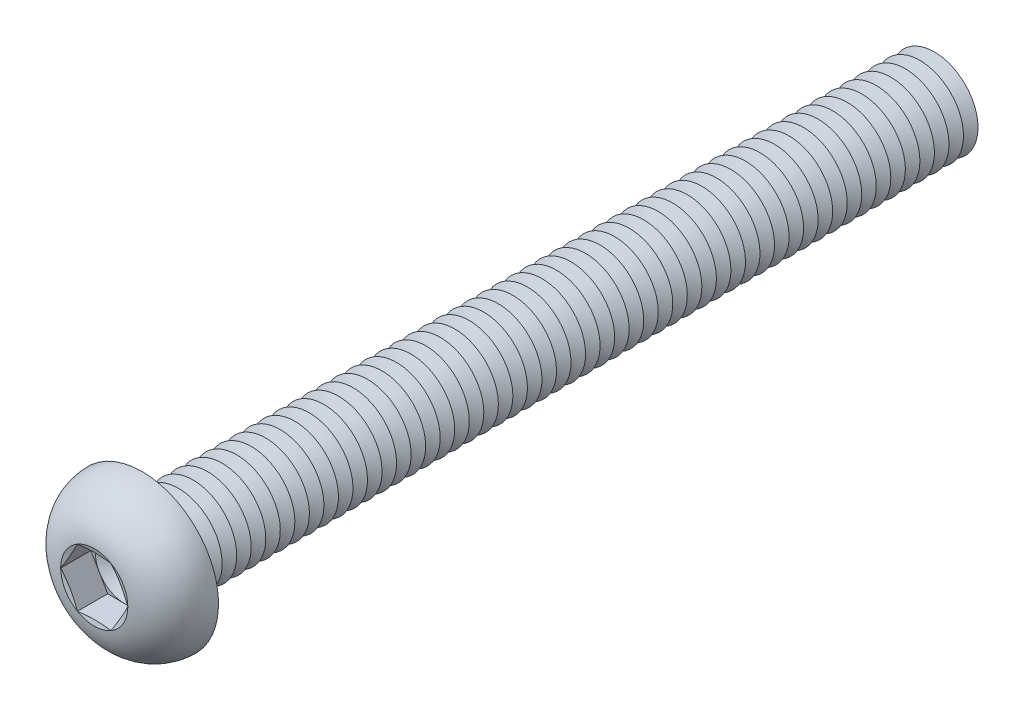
ISO-10303-21;
HEADER;
FILE_DESCRIPTION(('STEP AP214'),'2;1');
FILE_NAME('part.step','',(''),(''),'','','');
FILE_SCHEMA(('AUTOMOTIVE_DESIGN { 1 0 10303 214 1 1 1 1 }'));
ENDSEC;
DATA;
#1=APPLICATION_CONTEXT('core data for automotive mechanical design processes');
#2=APPLICATION_PROTOCOL_DEFINITION('international standard','automotive_design',2000,#1);
#3=PRODUCT_CONTEXT('',#1,'mechanical');
#4=PRODUCT('Part','Part','',(#3));
#5=PRODUCT_RELATED_PRODUCT_CATEGORY('part','',(#4));
#6=PRODUCT_DEFINITION_FORMATION('','',#4);
#7=PRODUCT_DEFINITION_CONTEXT('part definition',#1,'design');
#8=PRODUCT_DEFINITION('design','',#6,#7);
#9=PRODUCT_DEFINITION_SHAPE('','',#8);
#10=(LENGTH_UNIT() NAMED_UNIT(*) SI_UNIT(.MILLI.,.METRE.));
#11=(NAMED_UNIT(*) PLANE_ANGLE_UNIT() SI_UNIT($,.RADIAN.));
#12=(NAMED_UNIT(*) SI_UNIT($,.STERADIAN.) SOLID_ANGLE_UNIT());
#13=UNCERTAINTY_MEASURE_WITH_UNIT(LENGTH_MEASURE(1.E-05),#10,'distance_accuracy_value','');
#14=(GEOMETRIC_REPRESENTATION_CONTEXT(3) GLOBAL_UNCERTAINTY_ASSIGNED_CONTEXT((#13)) GLOBAL_UNIT_ASSIGNED_CONTEXT((#10,
#11,#12)) REPRESENTATION_CONTEXT('',''));
#15=CARTESIAN_POINT('',(0.,0.,0.));
#16=DIRECTION('',(0.,0.,1.));
#17=DIRECTION('',(1.,0.,0.));
#18=AXIS2_PLACEMENT_3D('',#15,#16,#17);
#19=CARTESIAN_POINT('',(0.,0.,1.22));
#20=DIRECTION('',(0.,0.,1.));
#21=DIRECTION('',(1.,0.,0.));
#22=AXIS2_PLACEMENT_3D('',#19,#20,#21);
#23=PLANE('',#22);
#24=CARTESIAN_POINT('',(0.,0.,1.22));
#25=DIRECTION('',(0.,0.,1.));
#26=DIRECTION('',(1.,0.,0.));
#27=AXIS2_PLACEMENT_3D('',#24,#25,#26);
#28=CIRCLE('',#27,1.99999906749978);
#29=CARTESIAN_POINT('',(1.73205,0.999999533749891,1.22));
#30=VERTEX_POINT('',#29);
#31=CARTESIAN_POINT('',(0.,1.99999906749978,1.22));
#32=VERTEX_POINT('',#31);
#33=EDGE_CURVE('E118',#30,#32,#28,.T.);
#34=ORIENTED_EDGE('',*,*,#33,.F.);
#35=DIRECTION('',(-0.5,0.866025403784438,0.));
#36=VECTOR('',#35,1.);
#37=CARTESIAN_POINT('',(2.3094,0.,1.22));
#38=LINE('',#37,#36);
#39=CARTESIAN_POINT('',(1.1547,1.99999906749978,1.22));
#40=VERTEX_POINT('',#39);
#41=EDGE_CURVE('E125',#30,#40,#38,.T.);
#42=ORIENTED_EDGE('',*,*,#41,.T.);
#43=DIRECTION('',(-1.,0.,0.));
#44=VECTOR('',#43,1.);
#45=CARTESIAN_POINT('',(1.1547,1.99999906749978,1.22));
#46=LINE('',#45,#44);
#47=EDGE_CURVE('E136',#40,#32,#46,.T.);
#48=ORIENTED_EDGE('',*,*,#47,.T.);
#49=EDGE_LOOP('',(#34,#42,#48));
#50=FACE_BOUND('',#49,.T.);
#51=ADVANCED_FACE('F39',(#50),#23,.T.);
#52=CARTESIAN_POINT('',(0.,0.,1.22));
#53=DIRECTION('',(0.,0.,1.));
#54=DIRECTION('',(1.,0.,0.));
#55=AXIS2_PLACEMENT_3D('',#52,#53,#54);
#56=CIRCLE('',#55,1.99999906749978);
#57=CARTESIAN_POINT('',(-1.73205,0.999999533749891,1.22));
#58=VERTEX_POINT('',#57);
#59=EDGE_CURVE('E11',#32,#58,#56,.T.);
#60=ORIENTED_EDGE('',*,*,#59,.F.);
#61=CARTESIAN_POINT('',(-1.1547,1.99999906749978,1.22));
#62=VERTEX_POINT('',#61);
#63=EDGE_CURVE('E131',#32,#62,#46,.T.);
#64=ORIENTED_EDGE('',*,*,#63,.T.);
#65=DIRECTION('',(-0.5,-0.866025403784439,0.));
#66=VECTOR('',#65,1.);
#67=CARTESIAN_POINT('',(-1.1547,1.99999906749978,1.22));
#68=LINE('',#67,#66);
#69=EDGE_CURVE('E134',#62,#58,#68,.T.);
#70=ORIENTED_EDGE('',*,*,#69,.T.);
#71=EDGE_LOOP('',(#60,#64,#70));
#72=FACE_BOUND('',#71,.T.);
#73=ADVANCED_FACE('F130',(#72),#23,.T.);
#74=CARTESIAN_POINT('',(-1.73205,-0.999999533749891,1.22));
#75=VERTEX_POINT('',#74);
#76=EDGE_CURVE('E49',#58,#75,#56,.T.);
#77=ORIENTED_EDGE('',*,*,#76,.F.);
#78=CARTESIAN_POINT('',(-2.3094,0.,1.22));
#79=VERTEX_POINT('',#78);
#80=EDGE_CURVE('E143',#58,#79,#68,.T.);
#81=ORIENTED_EDGE('',*,*,#80,.T.);
#82=DIRECTION('',(0.5,-0.866025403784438,0.));
#83=VECTOR('',#82,1.);
#84=CARTESIAN_POINT('',(-2.3094,0.,1.22));
#85=LINE('',#84,#83);
#86=EDGE_CURVE('E151',#79,#75,#85,.T.);
#87=ORIENTED_EDGE('',*,*,#86,.T.);
#88=EDGE_LOOP('',(#77,#81,#87));
#89=FACE_BOUND('',#88,.T.);
#90=ADVANCED_FACE('F709',(#89),#23,.T.);
#91=CARTESIAN_POINT('',(0.,-1.99999906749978,1.22));
#92=VERTEX_POINT('',#91);
#93=EDGE_CURVE('E691',#75,#92,#56,.T.);
#94=ORIENTED_EDGE('',*,*,#93,.F.);
#95=CARTESIAN_POINT('',(-1.1547,-1.99999906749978,1.22));
#96=VERTEX_POINT('',#95);
#97=EDGE_CURVE('E150',#75,#96,#85,.T.);
#98=ORIENTED_EDGE('',*,*,#97,.T.);
#99=DIRECTION('',(1.,0.,0.));
#100=VECTOR('',#99,1.);
#101=CARTESIAN_POINT('',(-1.1547,-1.99999906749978,1.22));
#102=LINE('',#101,#100);
#103=EDGE_CURVE('E156',#96,#92,#102,.T.);
#104=ORIENTED_EDGE('',*,*,#103,.T.);
#105=EDGE_LOOP('',(#94,#98,#104));
#106=FACE_BOUND('',#105,.T.);
#107=ADVANCED_FACE('F702',(#106),#23,.T.);
#108=CARTESIAN_POINT('',(1.73205,-0.999999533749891,1.22));
#109=VERTEX_POINT('',#108);
#110=EDGE_CURVE('E56',#92,#109,#56,.T.);
#111=ORIENTED_EDGE('',*,*,#110,.F.);
#112=CARTESIAN_POINT('',(1.1547,-1.99999906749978,1.22));
#113=VERTEX_POINT('',#112);
#114=EDGE_CURVE('E155',#92,#113,#102,.T.);
#115=ORIENTED_EDGE('',*,*,#114,.T.);
#116=DIRECTION('',(0.5,0.866025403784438,0.));
#117=VECTOR('',#116,1.);
#118=CARTESIAN_POINT('',(1.1547,-1.99999906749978,1.22));
#119=LINE('',#118,#117);
#120=EDGE_CURVE('E161',#113,#109,#119,.T.);
#121=ORIENTED_EDGE('',*,*,#120,.T.);
#122=EDGE_LOOP('',(#111,#115,#121));
#123=FACE_BOUND('',#122,.T.);
#124=ADVANCED_FACE('F778',(#123),#23,.T.);
#125=CARTESIAN_POINT('',(0.,0.,3.3));
#126=DIRECTION('',(0.,0.,1.));
#127=DIRECTION('',(0.,-1.,0.));
#128=AXIS2_PLACEMENT_3D('',#125,#126,#127);
#129=CONICAL_SURFACE('',#128,2.3094,1.30899693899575);
#130=CARTESIAN_POINT('',(2.30951547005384,-0.0002000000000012,3.30003094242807));
#131=CARTESIAN_POINT('',(2.26155412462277,0.082871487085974,3.2871729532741));
#132=CARTESIAN_POINT('',(2.21350580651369,0.166093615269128,3.27549992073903));
#133=CARTESIAN_POINT('',(2.11723944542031,0.332831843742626,3.2549913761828));
#134=CARTESIAN_POINT('',(2.06902134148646,0.416348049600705,3.24615701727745));
#135=CARTESIAN_POINT('',(1.97270782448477,0.583167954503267,3.23184167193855));
#136=CARTESIAN_POINT('',(1.92461306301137,0.666470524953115,3.22634360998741));
#137=CARTESIAN_POINT('',(1.82836219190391,0.833181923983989,3.21897125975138));
#138=CARTESIAN_POINT('',(1.78020609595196,0.916590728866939,3.21709626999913));
#139=CARTESIAN_POINT('',(1.68389390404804,1.08340833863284,3.21709626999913));
#140=CARTESIAN_POINT('',(1.63573780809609,1.16681714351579,3.21897125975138));
#141=CARTESIAN_POINT('',(1.53948693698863,1.33352854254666,3.22634360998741));
#142=CARTESIAN_POINT('',(1.49139217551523,1.41683111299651,3.23184167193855));
#143=CARTESIAN_POINT('',(1.39507865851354,1.58365101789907,3.24615701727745));
#144=CARTESIAN_POINT('',(1.34686055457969,1.66716722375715,3.2549913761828));
#145=CARTESIAN_POINT('',(1.25059419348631,1.83390545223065,3.27549992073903));
#146=CARTESIAN_POINT('',(1.20254587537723,1.9171275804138,3.2871729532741));
#147=CARTESIAN_POINT('',(1.15458452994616,2.00019906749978,3.30003094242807));
#148=B_SPLINE_CURVE_WITH_KNOTS('',3,(#130,#131,#132,#133,#134,#135,#136,#137,#138,#139,#140,
#141,#142,#143,#144,#145,#146,#147),.UNSPECIFIED.,.F.,.F.,(4,2,2,2,2,2,2,2,4),(0.,
0.290357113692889,0.580832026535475,0.869807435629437,1.15872689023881,1.44764634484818,
1.73662175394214,2.02709666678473,2.31745378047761),.UNSPECIFIED.);
#149=CARTESIAN_POINT('',(2.3094,0.,3.3));
#150=VERTEX_POINT('',#149);
#151=CARTESIAN_POINT('',(1.15469999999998,1.99999906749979,3.3));
#152=VERTEX_POINT('',#151);
#153=EDGE_CURVE('E220',#150,#152,#148,.T.);
#154=ORIENTED_EDGE('',*,*,#153,.F.);
#155=CARTESIAN_POINT('',(0.,0.,3.3));
#156=DIRECTION('',(0.,0.,-1.));
#157=DIRECTION('',(0.,1.,0.));
#158=AXIS2_PLACEMENT_3D('',#155,#156,#157);
#159=CIRCLE('',#158,2.3094);
#160=EDGE_CURVE('E676',#152,#150,#159,.T.);
#161=ORIENTED_EDGE('',*,*,#160,.F.);
#162=EDGE_LOOP('',(#154,#161));
#163=FACE_BOUND('',#162,.T.);
#164=ADVANCED_FACE('F782',(#163),#129,.F.);
#165=CARTESIAN_POINT('',(1.15458452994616,-2.00019906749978,3.30003094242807));
#166=CARTESIAN_POINT('',(1.20254587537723,-1.91712758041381,3.2871729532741));
#167=CARTESIAN_POINT('',(1.25059419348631,-1.83390545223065,3.27549992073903));
#168=CARTESIAN_POINT('',(1.34686055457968,-1.66716722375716,3.2549913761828));
#169=CARTESIAN_POINT('',(1.39507865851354,-1.58365101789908,3.24615701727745));
#170=CARTESIAN_POINT('',(1.49139217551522,-1.41683111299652,3.23184167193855));
#171=CARTESIAN_POINT('',(1.53948693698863,-1.33352854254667,3.22634360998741));
#172=CARTESIAN_POINT('',(1.63573780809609,-1.16681714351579,3.21897125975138));
#173=CARTESIAN_POINT('',(1.68389390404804,-1.08340833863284,3.21709626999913));
#174=CARTESIAN_POINT('',(1.78020609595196,-0.916590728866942,3.21709626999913));
#175=CARTESIAN_POINT('',(1.82836219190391,-0.833181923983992,3.21897125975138));
#176=CARTESIAN_POINT('',(1.92461306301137,-0.666470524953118,3.22634360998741));
#177=CARTESIAN_POINT('',(1.97270782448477,-0.58316795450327,3.23184167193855));
#178=CARTESIAN_POINT('',(2.06902134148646,-0.416348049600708,3.24615701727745));
#179=CARTESIAN_POINT('',(2.11723944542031,-0.332831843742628,3.2549913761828));
#180=CARTESIAN_POINT('',(2.21350580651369,-0.16609361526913,3.27549992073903));
#181=CARTESIAN_POINT('',(2.26155412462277,-0.0828714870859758,3.2871729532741));
#182=CARTESIAN_POINT('',(2.30951547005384,0.000199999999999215,3.30003094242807));
#183=B_SPLINE_CURVE_WITH_KNOTS('',3,(#165,#166,#167,#168,#169,#170,#171,#172,#173,#174,#175,
#176,#177,#178,#179,#180,#181,#182),.UNSPECIFIED.,.F.,.F.,(4,2,2,2,2,2,2,2,4),(0.,
0.290357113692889,0.580832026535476,0.869807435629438,1.15872689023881,1.44764634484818,
1.73662175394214,2.02709666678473,2.31745378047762),.UNSPECIFIED.);
#184=CARTESIAN_POINT('',(1.1547,-1.99999906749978,3.3));
#185=VERTEX_POINT('',#184);
#186=EDGE_CURVE('E229',#185,#150,#183,.T.);
#187=ORIENTED_EDGE('',*,*,#186,.F.);
#188=EDGE_CURVE('E681',#150,#185,#159,.T.);
#189=ORIENTED_EDGE('',*,*,#188,.F.);
#190=EDGE_LOOP('',(#187,#189));
#191=FACE_BOUND('',#190,.T.);
#192=ADVANCED_FACE('F743',(#191),#129,.F.);
#193=CARTESIAN_POINT('',(-3.4849337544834,-1.99999906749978,3.75783251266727));
#194=CARTESIAN_POINT('',(-3.40057136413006,-1.99999906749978,3.73822859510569));
#195=CARTESIAN_POINT('',(-3.31617090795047,-1.99999906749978,3.71878852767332));
#196=CARTESIAN_POINT('',(-3.14727791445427,-1.99999906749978,3.68030638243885));
#197=CARTESIAN_POINT('',(-3.06278537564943,-1.99999906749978,3.66126431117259));
#198=CARTESIAN_POINT('',(-2.80911712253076,-1.99999906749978,3.60483420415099));
#199=CARTESIAN_POINT('',(-2.63978343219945,-1.99999906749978,3.5681499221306));
#200=CARTESIAN_POINT('',(-2.29895421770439,-1.99999906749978,3.49717072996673));
#201=CARTESIAN_POINT('',(-2.12745330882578,-1.99999906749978,3.4629014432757));
#202=CARTESIAN_POINT('',(-1.78364663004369,-1.99999906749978,3.39849485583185));
#203=CARTESIAN_POINT('',(-1.61134079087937,-1.99999906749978,3.36835791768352));
#204=CARTESIAN_POINT('',(-1.27040784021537,-1.99999906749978,3.31501553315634));
#205=CARTESIAN_POINT('',(-1.10180724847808,-1.99999906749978,3.291644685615));
#206=CARTESIAN_POINT('',(-0.763641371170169,-1.99999906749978,3.2533727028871));
#207=CARTESIAN_POINT('',(-0.594076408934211,-1.99999906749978,3.23846888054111));
#208=CARTESIAN_POINT('',(-0.339649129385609,-1.99999906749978,3.22431372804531));
#209=CARTESIAN_POINT('',(-0.255009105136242,-1.99999906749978,3.22096057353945));
#210=CARTESIAN_POINT('',(-0.0856618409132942,-1.99999906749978,3.21711210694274));
#211=CARTESIAN_POINT('',(-0.000954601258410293,-1.99999906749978,3.2166167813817));
#212=CARTESIAN_POINT('',(0.16843098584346,-1.99999906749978,3.21851478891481));
#213=CARTESIAN_POINT('',(0.253109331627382,-1.99999906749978,3.2209082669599));
#214=CARTESIAN_POINT('',(0.422344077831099,-1.99999906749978,3.22845792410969));
#215=CARTESIAN_POINT('',(0.506900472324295,-1.99999906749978,3.23361423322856));
#216=CARTESIAN_POINT('',(0.712240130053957,-1.99999906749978,3.24921577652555));
#217=CARTESIAN_POINT('',(0.832922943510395,-1.99999906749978,3.26098285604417));
#218=CARTESIAN_POINT('',(1.07378161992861,-1.99999906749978,3.28874908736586));
#219=CARTESIAN_POINT('',(1.1939575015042,-1.99999906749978,3.30474808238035));
#220=CARTESIAN_POINT('',(1.43419655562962,-1.99999906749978,3.34009172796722));
#221=CARTESIAN_POINT('',(1.55425817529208,-1.99999906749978,3.35944677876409));
#222=CARTESIAN_POINT('',(1.79394991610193,-1.99999906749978,3.40067076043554));
#223=CARTESIAN_POINT('',(1.91358001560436,-1.99999906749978,3.42253981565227));
#224=CARTESIAN_POINT('',(2.15493405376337,-1.99999906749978,3.46864194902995));
#225=CARTESIAN_POINT('',(2.27665041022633,-1.99999906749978,3.49291441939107));
#226=CARTESIAN_POINT('',(2.51977680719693,-1.99999906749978,3.54294628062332));
#227=CARTESIAN_POINT('',(2.64118684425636,-1.99999906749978,3.56870568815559));
#228=CARTESIAN_POINT('',(2.88310060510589,-1.99999906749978,3.62120891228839));
#229=CARTESIAN_POINT('',(3.00360566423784,-1.99999906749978,3.6479466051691));
#230=CARTESIAN_POINT('',(3.24441021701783,-1.99999906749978,3.7022947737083));
#231=CARTESIAN_POINT('',(3.36470972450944,-1.99999906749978,3.72990518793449));
#232=CARTESIAN_POINT('',(3.4849337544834,-1.99999906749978,3.75783251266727));
#233=B_SPLINE_CURVE_WITH_KNOTS('',3,(#193,#194,#195,#196,#197,#198,#199,#200,#201,#202,#203,
#204,#205,#206,#207,#208,#209,#210,#211,#212,#213,#214,#215,#216,#217,#218,#219,#220,#221,#222,
#223,#224,#225,#226,#227,#228,#229,#230,#231,#232),.UNSPECIFIED.,.F.,.F.,(4,2,2,2,2,2,2,2,2,2,2,
2,2,2,2,2,2,2,2,4),(0.,0.259830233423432,0.519664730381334,1.03943435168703,1.56407662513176,
2.08876490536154,2.59926476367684,3.10960251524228,3.36367930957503,3.61775490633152,
3.87184325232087,4.1259435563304,4.48960924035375,4.85326145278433,5.21806142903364,
5.58287945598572,5.95520617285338,6.32753706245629,6.69784064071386,7.06811821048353),.UNSPECIFIED.);
#234=CARTESIAN_POINT('',(-1.1547,-1.99999906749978,3.3));
#235=VERTEX_POINT('',#234);
#236=EDGE_CURVE('E723',#235,#185,#233,.T.);
#237=ORIENTED_EDGE('',*,*,#236,.F.);
#238=EDGE_CURVE('E736',#185,#235,#159,.T.);
#239=ORIENTED_EDGE('',*,*,#238,.F.);
#240=EDGE_LOOP('',(#237,#239));
#241=FACE_BOUND('',#240,.T.);
#242=ADVANCED_FACE('F749',(#241),#129,.F.);
#243=CARTESIAN_POINT('',(-2.30951547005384,0.000199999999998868,3.30003094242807));
#244=CARTESIAN_POINT('',(-2.26155412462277,-0.0828714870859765,3.2871729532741));
#245=CARTESIAN_POINT('',(-2.21350580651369,-0.166093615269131,3.27549992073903));
#246=CARTESIAN_POINT('',(-2.11723944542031,-0.332831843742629,3.2549913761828));
#247=CARTESIAN_POINT('',(-2.06902134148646,-0.416348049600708,3.24615701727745));
#248=CARTESIAN_POINT('',(-1.97270782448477,-0.58316795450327,3.23184167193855));
#249=CARTESIAN_POINT('',(-1.92461306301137,-0.666470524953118,3.22634360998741));
#250=CARTESIAN_POINT('',(-1.82836219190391,-0.833181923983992,3.21897125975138));
#251=CARTESIAN_POINT('',(-1.78020609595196,-0.916590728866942,3.21709626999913));
#252=CARTESIAN_POINT('',(-1.68389390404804,-1.08340833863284,3.21709626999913));
#253=CARTESIAN_POINT('',(-1.63573780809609,-1.16681714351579,3.21897125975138));
#254=CARTESIAN_POINT('',(-1.53948693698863,-1.33352854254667,3.22634360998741));
#255=CARTESIAN_POINT('',(-1.49139217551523,-1.41683111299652,3.23184167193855));
#256=CARTESIAN_POINT('',(-1.39507865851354,-1.58365101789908,3.24615701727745));
#257=CARTESIAN_POINT('',(-1.34686055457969,-1.66716722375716,3.2549913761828));
#258=CARTESIAN_POINT('',(-1.25059419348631,-1.83390545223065,3.27549992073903));
#259=CARTESIAN_POINT('',(-1.20254587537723,-1.91712758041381,3.2871729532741));
#260=CARTESIAN_POINT('',(-1.15458452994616,-2.00019906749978,3.30003094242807));
#261=B_SPLINE_CURVE_WITH_KNOTS('',3,(#243,#244,#245,#246,#247,#248,#249,#250,#251,#252,#253,
#254,#255,#256,#257,#258,#259,#260),.UNSPECIFIED.,.F.,.F.,(4,2,2,2,2,2,2,2,4),(0.,
0.290357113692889,0.580832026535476,0.869807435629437,1.15872689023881,1.44764634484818,
1.73662175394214,2.02709666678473,2.31745378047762),.UNSPECIFIED.);
#262=CARTESIAN_POINT('',(-2.3094,0.,3.3));
#263=VERTEX_POINT('',#262);
#264=EDGE_CURVE('E714',#263,#235,#261,.T.);
#265=ORIENTED_EDGE('',*,*,#264,.F.);
#266=EDGE_CURVE('E720',#235,#263,#159,.T.);
#267=ORIENTED_EDGE('',*,*,#266,.F.);
#268=EDGE_LOOP('',(#265,#267));
#269=FACE_BOUND('',#268,.T.);
#270=ADVANCED_FACE('F718',(#269),#129,.F.);
#271=CARTESIAN_POINT('',(-1.15458452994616,2.00019906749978,3.30003094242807));
#272=CARTESIAN_POINT('',(-1.20254587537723,1.9171275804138,3.2871729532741));
#273=CARTESIAN_POINT('',(-1.25059419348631,1.83390545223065,3.27549992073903));
#274=CARTESIAN_POINT('',(-1.34686055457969,1.66716722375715,3.2549913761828));
#275=CARTESIAN_POINT('',(-1.39507865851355,1.58365101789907,3.24615701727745));
#276=CARTESIAN_POINT('',(-1.49139217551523,1.41683111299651,3.23184167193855));
#277=CARTESIAN_POINT('',(-1.53948693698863,1.33352854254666,3.22634360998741));
#278=CARTESIAN_POINT('',(-1.63573780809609,1.16681714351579,3.21897125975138));
#279=CARTESIAN_POINT('',(-1.68389390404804,1.08340833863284,3.21709626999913));
#280=CARTESIAN_POINT('',(-1.78020609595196,0.916590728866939,3.21709626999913));
#281=CARTESIAN_POINT('',(-1.82836219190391,0.833181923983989,3.21897125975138));
#282=CARTESIAN_POINT('',(-1.92461306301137,0.666470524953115,3.22634360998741));
#283=CARTESIAN_POINT('',(-1.97270782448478,0.583167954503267,3.23184167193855));
#284=CARTESIAN_POINT('',(-2.06902134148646,0.416348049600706,3.24615701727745));
#285=CARTESIAN_POINT('',(-2.11723944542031,0.332831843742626,3.2549913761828));
#286=CARTESIAN_POINT('',(-2.21350580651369,0.166093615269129,3.27549992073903));
#287=CARTESIAN_POINT('',(-2.26155412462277,0.0828714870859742,3.2871729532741));
#288=CARTESIAN_POINT('',(-2.30951547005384,-0.000200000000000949,3.30003094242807));
#289=B_SPLINE_CURVE_WITH_KNOTS('',3,(#271,#272,#273,#274,#275,#276,#277,#278,#279,#280,#281,
#282,#283,#284,#285,#286,#287,#288),.UNSPECIFIED.,.F.,.F.,(4,2,2,2,2,2,2,2,4),(0.,
0.290357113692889,0.580832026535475,0.869807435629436,1.15872689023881,1.44764634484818,
1.73662175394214,2.02709666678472,2.31745378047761),.UNSPECIFIED.);
#290=CARTESIAN_POINT('',(-1.1547,1.99999906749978,3.3));
#291=VERTEX_POINT('',#290);
#292=EDGE_CURVE('E194',#291,#263,#289,.T.);
#293=ORIENTED_EDGE('',*,*,#292,.F.);
#294=EDGE_CURVE('E726',#263,#291,#159,.T.);
#295=ORIENTED_EDGE('',*,*,#294,.F.);
#296=EDGE_LOOP('',(#293,#295));
#297=FACE_BOUND('',#296,.T.);
#298=ADVANCED_FACE('F727',(#297),#129,.F.);
#299=CARTESIAN_POINT('',(0.,0.,-51.5));
#300=DIRECTION('',(0.,0.,1.));
#301=DIRECTION('',(0.,-1.,0.));
#302=AXIS2_PLACEMENT_3D('',#299,#300,#301);
#303=CONICAL_SURFACE('',#302,2.99999999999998,1.0471975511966);
#304=CARTESIAN_POINT('',(0.,0.,-52.));
#305=DIRECTION('',(0.,0.,1.));
#306=DIRECTION('',(0.,-1.,0.));
#307=AXIS2_PLACEMENT_3D('',#304,#305,#306);
#308=CIRCLE('',#307,2.13397459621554);
#309=CARTESIAN_POINT('',(0.,-2.13397459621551,-52.));
#310=VERTEX_POINT('',#309);
#311=EDGE_CURVE('E647',#310,#310,#308,.T.);
#312=ORIENTED_EDGE('',*,*,#311,.T.);
#313=EDGE_LOOP('',(#312));
#314=FACE_BOUND('',#313,.T.);
#315=CARTESIAN_POINT('',(0.,0.,-51.5));
#316=DIRECTION('',(0.,0.,1.));
#317=DIRECTION('',(0.,-1.,0.));
#318=AXIS2_PLACEMENT_3D('',#315,#316,#317);
#319=CIRCLE('',#318,2.99999999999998);
#320=CARTESIAN_POINT('',(0.,-2.99999999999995,-51.5));
#321=VERTEX_POINT('',#320);
#322=EDGE_CURVE('E643',#321,#321,#319,.T.);
#323=ORIENTED_EDGE('',*,*,#322,.F.);
#324=EDGE_LOOP('',(#323));
#325=FACE_BOUND('',#324,.T.);
#326=ADVANCED_FACE('F809',(#314,#325),#303,.T.);
#327=CARTESIAN_POINT('',(0.,0.,-52.));
#328=DIRECTION('',(0.,0.,-1.));
#329=DIRECTION('',(0.,1.,0.));
#330=AXIS2_PLACEMENT_3D('',#327,#328,#329);
#331=CONICAL_SURFACE('',#330,2.13397459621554,1.0471975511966);
#332=CARTESIAN_POINT('',(0.,0.,-52.5));
#333=DIRECTION('',(0.,0.,1.));
#334=DIRECTION('',(0.,-1.,0.));
#335=AXIS2_PLACEMENT_3D('',#332,#333,#334);
#336=CIRCLE('',#335,2.99999999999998);
#337=CARTESIAN_POINT('',(0.,-2.99999999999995,-52.5));
#338=VERTEX_POINT('',#337);
#339=EDGE_CURVE('E651',#338,#338,#336,.T.);
#340=ORIENTED_EDGE('',*,*,#339,.T.);
#341=EDGE_LOOP('',(#340));
#342=FACE_BOUND('',#341,.T.);
#343=ORIENTED_EDGE('',*,*,#311,.F.);
#344=EDGE_LOOP('',(#343));
#345=FACE_BOUND('',#344,.T.);
#346=ADVANCED_FACE('F814',(#342,#345),#331,.T.);
#347=CARTESIAN_POINT('',(0.,2.99999999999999,-55.));
#348=DIRECTION('',(0.,0.,-1.));
#349=DIRECTION('',(0.,1.,0.));
#350=AXIS2_PLACEMENT_3D('',#347,#348,#349);
#351=PLANE('',#350);
#352=CARTESIAN_POINT('',(0.,0.,-55.));
#353=DIRECTION('',(0.,0.,1.));
#354=DIRECTION('',(0.,-1.,0.));
#355=AXIS2_PLACEMENT_3D('',#352,#353,#354);
#356=CIRCLE('',#355,2.13397459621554);
#357=CARTESIAN_POINT('',(0.,-2.13397459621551,-55.));
#358=VERTEX_POINT('',#357);
#359=EDGE_CURVE('E671',#358,#358,#356,.T.);
#360=ORIENTED_EDGE('',*,*,#359,.F.);
#361=EDGE_LOOP('',(#360));
#362=FACE_BOUND('',#361,.T.);
#363=ADVANCED_FACE('F981',(#362),#351,.T.);
#364=CARTESIAN_POINT('',(0.,0.,-54.5));
#365=DIRECTION('',(0.,0.,1.));
#366=DIRECTION('',(0.,-1.,0.));
#367=AXIS2_PLACEMENT_3D('',#364,#365,#366);
#368=CONICAL_SURFACE('',#367,2.99999999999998,1.0471975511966);
#369=ORIENTED_EDGE('',*,*,#359,.T.);
#370=EDGE_LOOP('',(#369));
#371=FACE_BOUND('',#370,.T.);
#372=CARTESIAN_POINT('',(0.,0.,-54.5));
#373=DIRECTION('',(0.,0.,1.));
#374=DIRECTION('',(0.,-1.,0.));
#375=AXIS2_PLACEMENT_3D('',#372,#373,#374);
#376=CIRCLE('',#375,2.99999999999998);
#377=CARTESIAN_POINT('',(0.,-2.99999999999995,-54.5));
#378=VERTEX_POINT('',#377);
#379=EDGE_CURVE('E667',#378,#378,#376,.T.);
#380=ORIENTED_EDGE('',*,*,#379,.F.);
#381=EDGE_LOOP('',(#380));
#382=FACE_BOUND('',#381,.T.);
#383=ADVANCED_FACE('F974',(#371,#382),#368,.T.);
#384=CARTESIAN_POINT('',(0.,0.,-54.));
#385=DIRECTION('',(0.,0.,-1.));
#386=DIRECTION('',(0.,1.,0.));
#387=AXIS2_PLACEMENT_3D('',#384,#385,#386);
#388=CONICAL_SURFACE('',#387,2.13397459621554,1.0471975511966);
#389=ORIENTED_EDGE('',*,*,#379,.T.);
#390=EDGE_LOOP('',(#389));
#391=FACE_BOUND('',#390,.T.);
#392=CARTESIAN_POINT('',(0.,0.,-54.));
#393=DIRECTION('',(0.,0.,1.));
#394=DIRECTION('',(0.,-1.,0.));
#395=AXIS2_PLACEMENT_3D('',#392,#393,#394);
#396=CIRCLE('',#395,2.13397459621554);
#397=CARTESIAN_POINT('',(0.,-2.13397459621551,-54.));
#398=VERTEX_POINT('',#397);
#399=EDGE_CURVE('E663',#398,#398,#396,.T.);
#400=ORIENTED_EDGE('',*,*,#399,.F.);
#401=EDGE_LOOP('',(#400));
#402=FACE_BOUND('',#401,.T.);
#403=ADVANCED_FACE('F980',(#391,#402),#388,.T.);
#404=CARTESIAN_POINT('',(0.,0.,-53.5));
#405=DIRECTION('',(0.,0.,1.));
#406=DIRECTION('',(0.,-1.,0.));
#407=AXIS2_PLACEMENT_3D('',#404,#405,#406);
#408=CONICAL_SURFACE('',#407,2.99999999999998,1.0471975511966);
#409=ORIENTED_EDGE('',*,*,#399,.T.);
#410=EDGE_LOOP('',(#409));
#411=FACE_BOUND('',#410,.T.);
#412=CARTESIAN_POINT('',(0.,0.,-53.5));
#413=DIRECTION('',(0.,0.,1.));
#414=DIRECTION('',(0.,-1.,0.));
#415=AXIS2_PLACEMENT_3D('',#412,#413,#414);
#416=CIRCLE('',#415,2.99999999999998);
#417=CARTESIAN_POINT('',(0.,-2.99999999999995,-53.5));
#418=VERTEX_POINT('',#417);
#419=EDGE_CURVE('E659',#418,#418,#416,.T.);
#420=ORIENTED_EDGE('',*,*,#419,.F.);
#421=EDGE_LOOP('',(#420));
#422=FACE_BOUND('',#421,.T.);
#423=ADVANCED_FACE('F1012',(#411,#422),#408,.T.);
#424=CARTESIAN_POINT('',(0.,0.,-53.));
#425=DIRECTION('',(0.,0.,-1.));
#426=DIRECTION('',(0.,1.,0.));
#427=AXIS2_PLACEMENT_3D('',#424,#425,#426);
#428=CONICAL_SURFACE('',#427,2.13397459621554,1.0471975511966);
#429=ORIENTED_EDGE('',*,*,#419,.T.);
#430=EDGE_LOOP('',(#429));
#431=FACE_BOUND('',#430,.T.);
#432=CARTESIAN_POINT('',(0.,0.,-53.));
#433=DIRECTION('',(0.,0.,1.));
#434=DIRECTION('',(0.,-1.,0.));
#435=AXIS2_PLACEMENT_3D('',#432,#433,#434);
#436=CIRCLE('',#435,2.13397459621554);
#437=CARTESIAN_POINT('',(0.,-2.13397459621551,-53.));
#438=VERTEX_POINT('',#437);
#439=EDGE_CURVE('E655',#438,#438,#436,.T.);
#440=ORIENTED_EDGE('',*,*,#439,.F.);
#441=EDGE_LOOP('',(#440));
#442=FACE_BOUND('',#441,.T.);
#443=ADVANCED_FACE('F1022',(#431,#442),#428,.T.);
#444=CARTESIAN_POINT('',(0.,0.,-52.5));
#445=DIRECTION('',(0.,0.,1.));
#446=DIRECTION('',(0.,-1.,0.));
#447=AXIS2_PLACEMENT_3D('',#444,#445,#446);
#448=CONICAL_SURFACE('',#447,2.99999999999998,1.0471975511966);
#449=ORIENTED_EDGE('',*,*,#439,.T.);
#450=EDGE_LOOP('',(#449));
#451=FACE_BOUND('',#450,.T.);
#452=ORIENTED_EDGE('',*,*,#339,.F.);
#453=EDGE_LOOP('',(#452));
#454=FACE_BOUND('',#453,.T.);
#455=ADVANCED_FACE('F1032',(#451,#454),#448,.T.);
#456=CARTESIAN_POINT('',(0.,0.,-50.5));
#457=DIRECTION('',(0.,0.,1.));
#458=DIRECTION('',(0.,-1.,0.));
#459=AXIS2_PLACEMENT_3D('',#456,#457,#458);
#460=CONICAL_SURFACE('',#459,2.99999999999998,1.0471975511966);
#461=CARTESIAN_POINT('',(0.,0.,-51.));
#462=DIRECTION('',(0.,0.,1.));
#463=DIRECTION('',(0.,-1.,0.));
#464=AXIS2_PLACEMENT_3D('',#461,#462,#463);
#465=CIRCLE('',#464,2.13397459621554);
#466=CARTESIAN_POINT('',(0.,-2.13397459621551,-51.));
#467=VERTEX_POINT('',#466);
#468=EDGE_CURVE('E639',#467,#467,#465,.T.);
#469=ORIENTED_EDGE('',*,*,#468,.T.);
#470=EDGE_LOOP('',(#469));
#471=FACE_BOUND('',#470,.T.);
#472=CARTESIAN_POINT('',(0.,0.,-50.5));
#473=DIRECTION('',(0.,0.,1.));
#474=DIRECTION('',(0.,-1.,0.));
#475=AXIS2_PLACEMENT_3D('',#472,#473,#474);
#476=CIRCLE('',#475,2.99999999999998);
#477=CARTESIAN_POINT('',(0.,-2.99999999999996,-50.5));
#478=VERTEX_POINT('',#477);
#479=EDGE_CURVE('E635',#478,#478,#476,.T.);
#480=ORIENTED_EDGE('',*,*,#479,.F.);
#481=EDGE_LOOP('',(#480));
#482=FACE_BOUND('',#481,.T.);
#483=ADVANCED_FACE('F1042',(#471,#482),#460,.T.);
#484=CARTESIAN_POINT('',(0.,0.,-51.));
#485=DIRECTION('',(0.,0.,-1.));
#486=DIRECTION('',(0.,1.,0.));
#487=AXIS2_PLACEMENT_3D('',#484,#485,#486);
#488=CONICAL_SURFACE('',#487,2.13397459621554,1.0471975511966);
#489=ORIENTED_EDGE('',*,*,#322,.T.);
#490=EDGE_LOOP('',(#489));
#491=FACE_BOUND('',#490,.T.);
#492=ORIENTED_EDGE('',*,*,#468,.F.);
#493=EDGE_LOOP('',(#492));
#494=FACE_BOUND('',#493,.T.);
#495=ADVANCED_FACE('F1052',(#491,#494),#488,.T.);
#496=CARTESIAN_POINT('',(0.,0.,-49.5));
#497=DIRECTION('',(0.,0.,1.));
#498=DIRECTION('',(0.,-1.,0.));
#499=AXIS2_PLACEMENT_3D('',#496,#497,#498);
#500=CONICAL_SURFACE('',#499,2.99999999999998,1.0471975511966);
#501=CARTESIAN_POINT('',(0.,0.,-50.));
#502=DIRECTION('',(0.,0.,1.));
#503=DIRECTION('',(0.,-1.,0.));
#504=AXIS2_PLACEMENT_3D('',#501,#502,#503);
#505=CIRCLE('',#504,2.13397459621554);
#506=CARTESIAN_POINT('',(0.,-2.13397459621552,-50.));
#507=VERTEX_POINT('',#506);
#508=EDGE_CURVE('E631',#507,#507,#505,.T.);
#509=ORIENTED_EDGE('',*,*,#508,.T.);
#510=EDGE_LOOP('',(#509));
#511=FACE_BOUND('',#510,.T.);
#512=CARTESIAN_POINT('',(0.,0.,-49.5));
#513=DIRECTION('',(0.,0.,1.));
#514=DIRECTION('',(0.,-1.,0.));
#515=AXIS2_PLACEMENT_3D('',#512,#513,#514);
#516=CIRCLE('',#515,2.99999999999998);
#517=CARTESIAN_POINT('',(0.,-2.99999999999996,-49.5));
#518=VERTEX_POINT('',#517);
#519=EDGE_CURVE('E627',#518,#518,#516,.T.);
#520=ORIENTED_EDGE('',*,*,#519,.F.);
#521=EDGE_LOOP('',(#520));
#522=FACE_BOUND('',#521,.T.);
#523=ADVANCED_FACE('F1062',(#511,#522),#500,.T.);
#524=CARTESIAN_POINT('',(0.,0.,-50.));
#525=DIRECTION('',(0.,0.,-1.));
#526=DIRECTION('',(0.,1.,0.));
#527=AXIS2_PLACEMENT_3D('',#524,#525,#526);
#528=CONICAL_SURFACE('',#527,2.13397459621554,1.0471975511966);
#529=ORIENTED_EDGE('',*,*,#479,.T.);
#530=EDGE_LOOP('',(#529));
#531=FACE_BOUND('',#530,.T.);
#532=ORIENTED_EDGE('',*,*,#508,.F.);
#533=EDGE_LOOP('',(#532));
#534=FACE_BOUND('',#533,.T.);
#535=ADVANCED_FACE('F1072',(#531,#534),#528,.T.);
#536=CARTESIAN_POINT('',(0.,0.,-48.5));
#537=DIRECTION('',(0.,0.,1.));
#538=DIRECTION('',(0.,-1.,0.));
#539=AXIS2_PLACEMENT_3D('',#536,#537,#538);
#540=CONICAL_SURFACE('',#539,2.99999999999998,1.0471975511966);
#541=CARTESIAN_POINT('',(0.,0.,-49.));
#542=DIRECTION('',(0.,0.,1.));
#543=DIRECTION('',(0.,-1.,0.));
#544=AXIS2_PLACEMENT_3D('',#541,#542,#543);
#545=CIRCLE('',#544,2.13397459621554);
#546=CARTESIAN_POINT('',(0.,-2.13397459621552,-49.));
#547=VERTEX_POINT('',#546);
#548=EDGE_CURVE('E623',#547,#547,#545,.T.);
#549=ORIENTED_EDGE('',*,*,#548,.T.);
#550=EDGE_LOOP('',(#549));
#551=FACE_BOUND('',#550,.T.);
#552=CARTESIAN_POINT('',(0.,0.,-48.5));
#553=DIRECTION('',(0.,0.,1.));
#554=DIRECTION('',(0.,-1.,0.));
#555=AXIS2_PLACEMENT_3D('',#552,#553,#554);
#556=CIRCLE('',#555,2.99999999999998);
#557=CARTESIAN_POINT('',(0.,-2.99999999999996,-48.5));
#558=VERTEX_POINT('',#557);
#559=EDGE_CURVE('E619',#558,#558,#556,.T.);
#560=ORIENTED_EDGE('',*,*,#559,.F.);
#561=EDGE_LOOP('',(#560));
#562=FACE_BOUND('',#561,.T.);
#563=ADVANCED_FACE('F1082',(#551,#562),#540,.T.);
#564=CARTESIAN_POINT('',(0.,0.,-49.));
#565=DIRECTION('',(0.,0.,-1.));
#566=DIRECTION('',(0.,1.,0.));
#567=AXIS2_PLACEMENT_3D('',#564,#565,#566);
#568=CONICAL_SURFACE('',#567,2.13397459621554,1.0471975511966);
#569=ORIENTED_EDGE('',*,*,#519,.T.);
#570=EDGE_LOOP('',(#569));
#571=FACE_BOUND('',#570,.T.);
#572=ORIENTED_EDGE('',*,*,#548,.F.);
#573=EDGE_LOOP('',(#572));
#574=FACE_BOUND('',#573,.T.);
#575=ADVANCED_FACE('F1092',(#571,#574),#568,.T.);
#576=CARTESIAN_POINT('',(0.,0.,-47.5));
#577=DIRECTION('',(0.,0.,1.));
#578=DIRECTION('',(0.,-1.,0.));
#579=AXIS2_PLACEMENT_3D('',#576,#577,#578);
#580=CONICAL_SURFACE('',#579,2.99999999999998,1.0471975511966);
#581=CARTESIAN_POINT('',(0.,0.,-48.));
#582=DIRECTION('',(0.,0.,1.));
#583=DIRECTION('',(0.,-1.,0.));
#584=AXIS2_PLACEMENT_3D('',#581,#582,#583);
#585=CIRCLE('',#584,2.13397459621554);
#586=CARTESIAN_POINT('',(0.,-2.13397459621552,-48.));
#587=VERTEX_POINT('',#586);
#588=EDGE_CURVE('E615',#587,#587,#585,.T.);
#589=ORIENTED_EDGE('',*,*,#588,.T.);
#590=EDGE_LOOP('',(#589));
#591=FACE_BOUND('',#590,.T.);
#592=CARTESIAN_POINT('',(0.,0.,-47.5));
#593=DIRECTION('',(0.,0.,1.));
#594=DIRECTION('',(0.,-1.,0.));
#595=AXIS2_PLACEMENT_3D('',#592,#593,#594);
#596=CIRCLE('',#595,2.99999999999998);
#597=CARTESIAN_POINT('',(0.,-2.99999999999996,-47.5));
#598=VERTEX_POINT('',#597);
#599=EDGE_CURVE('E611',#598,#598,#596,.T.);
#600=ORIENTED_EDGE('',*,*,#599,.F.);
#601=EDGE_LOOP('',(#600));
#602=FACE_BOUND('',#601,.T.);
#603=ADVANCED_FACE('F1102',(#591,#602),#580,.T.);
#604=CARTESIAN_POINT('',(0.,0.,-48.));
#605=DIRECTION('',(0.,0.,-1.));
#606=DIRECTION('',(0.,1.,0.));
#607=AXIS2_PLACEMENT_3D('',#604,#605,#606);
#608=CONICAL_SURFACE('',#607,2.13397459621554,1.0471975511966);
#609=ORIENTED_EDGE('',*,*,#559,.T.);
#610=EDGE_LOOP('',(#609));
#611=FACE_BOUND('',#610,.T.);
#612=ORIENTED_EDGE('',*,*,#588,.F.);
#613=EDGE_LOOP('',(#612));
#614=FACE_BOUND('',#613,.T.);
#615=ADVANCED_FACE('F1112',(#611,#614),#608,.T.);
#616=CARTESIAN_POINT('',(0.,0.,-46.5));
#617=DIRECTION('',(0.,0.,1.));
#618=DIRECTION('',(0.,-1.,0.));
#619=AXIS2_PLACEMENT_3D('',#616,#617,#618);
#620=CONICAL_SURFACE('',#619,2.99999999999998,1.0471975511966);
#621=CARTESIAN_POINT('',(0.,0.,-47.));
#622=DIRECTION('',(0.,0.,1.));
#623=DIRECTION('',(0.,-1.,0.));
#624=AXIS2_PLACEMENT_3D('',#621,#622,#623);
#625=CIRCLE('',#624,2.13397459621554);
#626=CARTESIAN_POINT('',(0.,-2.13397459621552,-47.));
#627=VERTEX_POINT('',#626);
#628=EDGE_CURVE('E607',#627,#627,#625,.T.);
#629=ORIENTED_EDGE('',*,*,#628,.T.);
#630=EDGE_LOOP('',(#629));
#631=FACE_BOUND('',#630,.T.);
#632=CARTESIAN_POINT('',(0.,0.,-46.5));
#633=DIRECTION('',(0.,0.,1.));
#634=DIRECTION('',(0.,-1.,0.));
#635=AXIS2_PLACEMENT_3D('',#632,#633,#634);
#636=CIRCLE('',#635,2.99999999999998);
#637=CARTESIAN_POINT('',(0.,-2.99999999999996,-46.5));
#638=VERTEX_POINT('',#637);
#639=EDGE_CURVE('E603',#638,#638,#636,.T.);
#640=ORIENTED_EDGE('',*,*,#639,.F.);
#641=EDGE_LOOP('',(#640));
#642=FACE_BOUND('',#641,.T.);
#643=ADVANCED_FACE('F1122',(#631,#642),#620,.T.);
#644=CARTESIAN_POINT('',(0.,0.,-47.));
#645=DIRECTION('',(0.,0.,-1.));
#646=DIRECTION('',(0.,1.,0.));
#647=AXIS2_PLACEMENT_3D('',#644,#645,#646);
#648=CONICAL_SURFACE('',#647,2.13397459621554,1.0471975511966);
#649=ORIENTED_EDGE('',*,*,#599,.T.);
#650=EDGE_LOOP('',(#649));
#651=FACE_BOUND('',#650,.T.);
#652=ORIENTED_EDGE('',*,*,#628,.F.);
#653=EDGE_LOOP('',(#652));
#654=FACE_BOUND('',#653,.T.);
#655=ADVANCED_FACE('F1132',(#651,#654),#648,.T.);
#656=CARTESIAN_POINT('',(0.,0.,-45.5));
#657=DIRECTION('',(0.,0.,1.));
#658=DIRECTION('',(0.,-1.,0.));
#659=AXIS2_PLACEMENT_3D('',#656,#657,#658);
#660=CONICAL_SURFACE('',#659,2.99999999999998,1.0471975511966);
#661=CARTESIAN_POINT('',(0.,0.,-46.));
#662=DIRECTION('',(0.,0.,1.));
#663=DIRECTION('',(0.,-1.,0.));
#664=AXIS2_PLACEMENT_3D('',#661,#662,#663);
#665=CIRCLE('',#664,2.13397459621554);
#666=CARTESIAN_POINT('',(0.,-2.13397459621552,-46.));
#667=VERTEX_POINT('',#666);
#668=EDGE_CURVE('E599',#667,#667,#665,.T.);
#669=ORIENTED_EDGE('',*,*,#668,.T.);
#670=EDGE_LOOP('',(#669));
#671=FACE_BOUND('',#670,.T.);
#672=CARTESIAN_POINT('',(0.,0.,-45.5));
#673=DIRECTION('',(0.,0.,1.));
#674=DIRECTION('',(0.,-1.,0.));
#675=AXIS2_PLACEMENT_3D('',#672,#673,#674);
#676=CIRCLE('',#675,2.99999999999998);
#677=CARTESIAN_POINT('',(0.,-2.99999999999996,-45.5));
#678=VERTEX_POINT('',#677);
#679=EDGE_CURVE('E595',#678,#678,#676,.T.);
#680=ORIENTED_EDGE('',*,*,#679,.F.);
#681=EDGE_LOOP('',(#680));
#682=FACE_BOUND('',#681,.T.);
#683=ADVANCED_FACE('F1142',(#671,#682),#660,.T.);
#684=CARTESIAN_POINT('',(0.,0.,-46.));
#685=DIRECTION('',(0.,0.,-1.));
#686=DIRECTION('',(0.,1.,0.));
#687=AXIS2_PLACEMENT_3D('',#684,#685,#686);
#688=CONICAL_SURFACE('',#687,2.13397459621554,1.0471975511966);
#689=ORIENTED_EDGE('',*,*,#639,.T.);
#690=EDGE_LOOP('',(#689));
#691=FACE_BOUND('',#690,.T.);
#692=ORIENTED_EDGE('',*,*,#668,.F.);
#693=EDGE_LOOP('',(#692));
#694=FACE_BOUND('',#693,.T.);
#695=ADVANCED_FACE('F1152',(#691,#694),#688,.T.);
#696=CARTESIAN_POINT('',(0.,0.,-44.5));
#697=DIRECTION('',(0.,0.,1.));
#698=DIRECTION('',(0.,-1.,0.));
#699=AXIS2_PLACEMENT_3D('',#696,#697,#698);
#700=CONICAL_SURFACE('',#699,2.99999999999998,1.0471975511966);
#701=CARTESIAN_POINT('',(0.,0.,-45.));
#702=DIRECTION('',(0.,0.,1.));
#703=DIRECTION('',(0.,-1.,0.));
#704=AXIS2_PLACEMENT_3D('',#701,#702,#703);
#705=CIRCLE('',#704,2.13397459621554);
#706=CARTESIAN_POINT('',(0.,-2.13397459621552,-45.));
#707=VERTEX_POINT('',#706);
#708=EDGE_CURVE('E591',#707,#707,#705,.T.);
#709=ORIENTED_EDGE('',*,*,#708,.T.);
#710=EDGE_LOOP('',(#709));
#711=FACE_BOUND('',#710,.T.);
#712=CARTESIAN_POINT('',(0.,0.,-44.5));
#713=DIRECTION('',(0.,0.,1.));
#714=DIRECTION('',(0.,-1.,0.));
#715=AXIS2_PLACEMENT_3D('',#712,#713,#714);
#716=CIRCLE('',#715,2.99999999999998);
#717=CARTESIAN_POINT('',(0.,-2.99999999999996,-44.5));
#718=VERTEX_POINT('',#717);
#719=EDGE_CURVE('E587',#718,#718,#716,.T.);
#720=ORIENTED_EDGE('',*,*,#719,.F.);
#721=EDGE_LOOP('',(#720));
#722=FACE_BOUND('',#721,.T.);
#723=ADVANCED_FACE('F1162',(#711,#722),#700,.T.);
#724=CARTESIAN_POINT('',(0.,0.,-45.));
#725=DIRECTION('',(0.,0.,-1.));
#726=DIRECTION('',(0.,1.,0.));
#727=AXIS2_PLACEMENT_3D('',#724,#725,#726);
#728=CONICAL_SURFACE('',#727,2.13397459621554,1.0471975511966);
#729=ORIENTED_EDGE('',*,*,#679,.T.);
#730=EDGE_LOOP('',(#729));
#731=FACE_BOUND('',#730,.T.);
#732=ORIENTED_EDGE('',*,*,#708,.F.);
#733=EDGE_LOOP('',(#732));
#734=FACE_BOUND('',#733,.T.);
#735=ADVANCED_FACE('F1172',(#731,#734),#728,.T.);
#736=CARTESIAN_POINT('',(0.,0.,-43.5));
#737=DIRECTION('',(0.,0.,1.));
#738=DIRECTION('',(0.,-1.,0.));
#739=AXIS2_PLACEMENT_3D('',#736,#737,#738);
#740=CONICAL_SURFACE('',#739,2.99999999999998,1.0471975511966);
#741=CARTESIAN_POINT('',(0.,0.,-44.));
#742=DIRECTION('',(0.,0.,1.));
#743=DIRECTION('',(0.,-1.,0.));
#744=AXIS2_PLACEMENT_3D('',#741,#742,#743);
#745=CIRCLE('',#744,2.13397459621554);
#746=CARTESIAN_POINT('',(0.,-2.13397459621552,-44.));
#747=VERTEX_POINT('',#746);
#748=EDGE_CURVE('E583',#747,#747,#745,.T.);
#749=ORIENTED_EDGE('',*,*,#748,.T.);
#750=EDGE_LOOP('',(#749));
#751=FACE_BOUND('',#750,.T.);
#752=CARTESIAN_POINT('',(0.,0.,-43.5));
#753=DIRECTION('',(0.,0.,1.));
#754=DIRECTION('',(0.,-1.,0.));
#755=AXIS2_PLACEMENT_3D('',#752,#753,#754);
#756=CIRCLE('',#755,2.99999999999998);
#757=CARTESIAN_POINT('',(0.,-2.99999999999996,-43.5));
#758=VERTEX_POINT('',#757);
#759=EDGE_CURVE('E579',#758,#758,#756,.T.);
#760=ORIENTED_EDGE('',*,*,#759,.F.);
#761=EDGE_LOOP('',(#760));
#762=FACE_BOUND('',#761,.T.);
#763=ADVANCED_FACE('F1182',(#751,#762),#740,.T.);
#764=CARTESIAN_POINT('',(0.,0.,-44.));
#765=DIRECTION('',(0.,0.,-1.));
#766=DIRECTION('',(0.,1.,0.));
#767=AXIS2_PLACEMENT_3D('',#764,#765,#766);
#768=CONICAL_SURFACE('',#767,2.13397459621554,1.0471975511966);
#769=ORIENTED_EDGE('',*,*,#719,.T.);
#770=EDGE_LOOP('',(#769));
#771=FACE_BOUND('',#770,.T.);
#772=ORIENTED_EDGE('',*,*,#748,.F.);
#773=EDGE_LOOP('',(#772));
#774=FACE_BOUND('',#773,.T.);
#775=ADVANCED_FACE('F1192',(#771,#774),#768,.T.);
#776=CARTESIAN_POINT('',(0.,0.,-42.5));
#777=DIRECTION('',(0.,0.,1.));
#778=DIRECTION('',(0.,-1.,0.));
#779=AXIS2_PLACEMENT_3D('',#776,#777,#778);
#780=CONICAL_SURFACE('',#779,2.99999999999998,1.0471975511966);
#781=CARTESIAN_POINT('',(0.,0.,-43.));
#782=DIRECTION('',(0.,0.,1.));
#783=DIRECTION('',(0.,-1.,0.));
#784=AXIS2_PLACEMENT_3D('',#781,#782,#783);
#785=CIRCLE('',#784,2.13397459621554);
#786=CARTESIAN_POINT('',(0.,-2.13397459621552,-43.));
#787=VERTEX_POINT('',#786);
#788=EDGE_CURVE('E575',#787,#787,#785,.T.);
#789=ORIENTED_EDGE('',*,*,#788,.T.);
#790=EDGE_LOOP('',(#789));
#791=FACE_BOUND('',#790,.T.);
#792=CARTESIAN_POINT('',(0.,0.,-42.5));
#793=DIRECTION('',(0.,0.,1.));
#794=DIRECTION('',(0.,-1.,0.));
#795=AXIS2_PLACEMENT_3D('',#792,#793,#794);
#796=CIRCLE('',#795,2.99999999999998);
#797=CARTESIAN_POINT('',(0.,-2.99999999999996,-42.5));
#798=VERTEX_POINT('',#797);
#799=EDGE_CURVE('E571',#798,#798,#796,.T.);
#800=ORIENTED_EDGE('',*,*,#799,.F.);
#801=EDGE_LOOP('',(#800));
#802=FACE_BOUND('',#801,.T.);
#803=ADVANCED_FACE('F1202',(#791,#802),#780,.T.);
#804=CARTESIAN_POINT('',(0.,0.,-43.));
#805=DIRECTION('',(0.,0.,-1.));
#806=DIRECTION('',(0.,1.,0.));
#807=AXIS2_PLACEMENT_3D('',#804,#805,#806);
#808=CONICAL_SURFACE('',#807,2.13397459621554,1.0471975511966);
#809=ORIENTED_EDGE('',*,*,#759,.T.);
#810=EDGE_LOOP('',(#809));
#811=FACE_BOUND('',#810,.T.);
#812=ORIENTED_EDGE('',*,*,#788,.F.);
#813=EDGE_LOOP('',(#812));
#814=FACE_BOUND('',#813,.T.);
#815=ADVANCED_FACE('F1212',(#811,#814),#808,.T.);
#816=CARTESIAN_POINT('',(0.,0.,-41.5));
#817=DIRECTION('',(0.,0.,1.));
#818=DIRECTION('',(0.,-1.,0.));
#819=AXIS2_PLACEMENT_3D('',#816,#817,#818);
#820=CONICAL_SURFACE('',#819,2.99999999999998,1.0471975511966);
#821=CARTESIAN_POINT('',(0.,0.,-42.));
#822=DIRECTION('',(0.,0.,1.));
#823=DIRECTION('',(0.,-1.,0.));
#824=AXIS2_PLACEMENT_3D('',#821,#822,#823);
#825=CIRCLE('',#824,2.13397459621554);
#826=CARTESIAN_POINT('',(0.,-2.13397459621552,-42.));
#827=VERTEX_POINT('',#826);
#828=EDGE_CURVE('E567',#827,#827,#825,.T.);
#829=ORIENTED_EDGE('',*,*,#828,.T.);
#830=EDGE_LOOP('',(#829));
#831=FACE_BOUND('',#830,.T.);
#832=CARTESIAN_POINT('',(0.,0.,-41.5));
#833=DIRECTION('',(0.,0.,1.));
#834=DIRECTION('',(0.,-1.,0.));
#835=AXIS2_PLACEMENT_3D('',#832,#833,#834);
#836=CIRCLE('',#835,2.99999999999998);
#837=CARTESIAN_POINT('',(0.,-2.99999999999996,-41.5));
#838=VERTEX_POINT('',#837);
#839=EDGE_CURVE('E563',#838,#838,#836,.T.);
#840=ORIENTED_EDGE('',*,*,#839,.F.);
#841=EDGE_LOOP('',(#840));
#842=FACE_BOUND('',#841,.T.);
#843=ADVANCED_FACE('F1222',(#831,#842),#820,.T.);
#844=CARTESIAN_POINT('',(0.,0.,-42.));
#845=DIRECTION('',(0.,0.,-1.));
#846=DIRECTION('',(0.,1.,0.));
#847=AXIS2_PLACEMENT_3D('',#844,#845,#846);
#848=CONICAL_SURFACE('',#847,2.13397459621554,1.0471975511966);
#849=ORIENTED_EDGE('',*,*,#799,.T.);
#850=EDGE_LOOP('',(#849));
#851=FACE_BOUND('',#850,.T.);
#852=ORIENTED_EDGE('',*,*,#828,.F.);
#853=EDGE_LOOP('',(#852));
#854=FACE_BOUND('',#853,.T.);
#855=ADVANCED_FACE('F1232',(#851,#854),#848,.T.);
#856=CARTESIAN_POINT('',(0.,0.,-40.5));
#857=DIRECTION('',(0.,0.,1.));
#858=DIRECTION('',(0.,-1.,0.));
#859=AXIS2_PLACEMENT_3D('',#856,#857,#858);
#860=CONICAL_SURFACE('',#859,2.99999999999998,1.0471975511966);
#861=CARTESIAN_POINT('',(0.,0.,-41.));
#862=DIRECTION('',(0.,0.,1.));
#863=DIRECTION('',(0.,-1.,0.));
#864=AXIS2_PLACEMENT_3D('',#861,#862,#863);
#865=CIRCLE('',#864,2.13397459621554);
#866=CARTESIAN_POINT('',(0.,-2.13397459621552,-41.));
#867=VERTEX_POINT('',#866);
#868=EDGE_CURVE('E559',#867,#867,#865,.T.);
#869=ORIENTED_EDGE('',*,*,#868,.T.);
#870=EDGE_LOOP('',(#869));
#871=FACE_BOUND('',#870,.T.);
#872=CARTESIAN_POINT('',(0.,0.,-40.5));
#873=DIRECTION('',(0.,0.,1.));
#874=DIRECTION('',(0.,-1.,0.));
#875=AXIS2_PLACEMENT_3D('',#872,#873,#874);
#876=CIRCLE('',#875,2.99999999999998);
#877=CARTESIAN_POINT('',(0.,-2.99999999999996,-40.5));
#878=VERTEX_POINT('',#877);
#879=EDGE_CURVE('E555',#878,#878,#876,.T.);
#880=ORIENTED_EDGE('',*,*,#879,.F.);
#881=EDGE_LOOP('',(#880));
#882=FACE_BOUND('',#881,.T.);
#883=ADVANCED_FACE('F1242',(#871,#882),#860,.T.);
#884=CARTESIAN_POINT('',(0.,0.,-41.));
#885=DIRECTION('',(0.,0.,-1.));
#886=DIRECTION('',(0.,1.,0.));
#887=AXIS2_PLACEMENT_3D('',#884,#885,#886);
#888=CONICAL_SURFACE('',#887,2.13397459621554,1.0471975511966);
#889=ORIENTED_EDGE('',*,*,#839,.T.);
#890=EDGE_LOOP('',(#889));
#891=FACE_BOUND('',#890,.T.);
#892=ORIENTED_EDGE('',*,*,#868,.F.);
#893=EDGE_LOOP('',(#892));
#894=FACE_BOUND('',#893,.T.);
#895=ADVANCED_FACE('F1252',(#891,#894),#888,.T.);
#896=CARTESIAN_POINT('',(0.,0.,-39.5));
#897=DIRECTION('',(0.,0.,1.));
#898=DIRECTION('',(0.,-1.,0.));
#899=AXIS2_PLACEMENT_3D('',#896,#897,#898);
#900=CONICAL_SURFACE('',#899,2.99999999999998,1.0471975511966);
#901=CARTESIAN_POINT('',(0.,0.,-40.));
#902=DIRECTION('',(0.,0.,1.));
#903=DIRECTION('',(0.,-1.,0.));
#904=AXIS2_PLACEMENT_3D('',#901,#902,#903);
#905=CIRCLE('',#904,2.13397459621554);
#906=CARTESIAN_POINT('',(0.,-2.13397459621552,-40.));
#907=VERTEX_POINT('',#906);
#908=EDGE_CURVE('E551',#907,#907,#905,.T.);
#909=ORIENTED_EDGE('',*,*,#908,.T.);
#910=EDGE_LOOP('',(#909));
#911=FACE_BOUND('',#910,.T.);
#912=CARTESIAN_POINT('',(0.,0.,-39.5));
#913=DIRECTION('',(0.,0.,1.));
#914=DIRECTION('',(0.,-1.,0.));
#915=AXIS2_PLACEMENT_3D('',#912,#913,#914);
#916=CIRCLE('',#915,2.99999999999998);
#917=CARTESIAN_POINT('',(0.,-2.99999999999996,-39.5));
#918=VERTEX_POINT('',#917);
#919=EDGE_CURVE('E547',#918,#918,#916,.T.);
#920=ORIENTED_EDGE('',*,*,#919,.F.);
#921=EDGE_LOOP('',(#920));
#922=FACE_BOUND('',#921,.T.);
#923=ADVANCED_FACE('F1262',(#911,#922),#900,.T.);
#924=CARTESIAN_POINT('',(0.,0.,-40.));
#925=DIRECTION('',(0.,0.,-1.));
#926=DIRECTION('',(0.,1.,0.));
#927=AXIS2_PLACEMENT_3D('',#924,#925,#926);
#928=CONICAL_SURFACE('',#927,2.13397459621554,1.0471975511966);
#929=ORIENTED_EDGE('',*,*,#879,.T.);
#930=EDGE_LOOP('',(#929));
#931=FACE_BOUND('',#930,.T.);
#932=ORIENTED_EDGE('',*,*,#908,.F.);
#933=EDGE_LOOP('',(#932));
#934=FACE_BOUND('',#933,.T.);
#935=ADVANCED_FACE('F1272',(#931,#934),#928,.T.);
#936=CARTESIAN_POINT('',(0.,0.,-38.5));
#937=DIRECTION('',(0.,0.,1.));
#938=DIRECTION('',(0.,-1.,0.));
#939=AXIS2_PLACEMENT_3D('',#936,#937,#938);
#940=CONICAL_SURFACE('',#939,2.99999999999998,1.0471975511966);
#941=CARTESIAN_POINT('',(0.,0.,-39.));
#942=DIRECTION('',(0.,0.,1.));
#943=DIRECTION('',(0.,-1.,0.));
#944=AXIS2_PLACEMENT_3D('',#941,#942,#943);
#945=CIRCLE('',#944,2.13397459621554);
#946=CARTESIAN_POINT('',(0.,-2.13397459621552,-39.));
#947=VERTEX_POINT('',#946);
#948=EDGE_CURVE('E543',#947,#947,#945,.T.);
#949=ORIENTED_EDGE('',*,*,#948,.T.);
#950=EDGE_LOOP('',(#949));
#951=FACE_BOUND('',#950,.T.);
#952=CARTESIAN_POINT('',(0.,0.,-38.5));
#953=DIRECTION('',(0.,0.,1.));
#954=DIRECTION('',(0.,-1.,0.));
#955=AXIS2_PLACEMENT_3D('',#952,#953,#954);
#956=CIRCLE('',#955,2.99999999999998);
#957=CARTESIAN_POINT('',(0.,-2.99999999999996,-38.5));
#958=VERTEX_POINT('',#957);
#959=EDGE_CURVE('E539',#958,#958,#956,.T.);
#960=ORIENTED_EDGE('',*,*,#959,.F.);
#961=EDGE_LOOP('',(#960));
#962=FACE_BOUND('',#961,.T.);
#963=ADVANCED_FACE('F1282',(#951,#962),#940,.T.);
#964=CARTESIAN_POINT('',(0.,0.,-39.));
#965=DIRECTION('',(0.,0.,-1.));
#966=DIRECTION('',(0.,1.,0.));
#967=AXIS2_PLACEMENT_3D('',#964,#965,#966);
#968=CONICAL_SURFACE('',#967,2.13397459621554,1.0471975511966);
#969=ORIENTED_EDGE('',*,*,#919,.T.);
#970=EDGE_LOOP('',(#969));
#971=FACE_BOUND('',#970,.T.);
#972=ORIENTED_EDGE('',*,*,#948,.F.);
#973=EDGE_LOOP('',(#972));
#974=FACE_BOUND('',#973,.T.);
#975=ADVANCED_FACE('F1292',(#971,#974),#968,.T.);
#976=CARTESIAN_POINT('',(0.,0.,-37.5));
#977=DIRECTION('',(0.,0.,1.));
#978=DIRECTION('',(0.,-1.,0.));
#979=AXIS2_PLACEMENT_3D('',#976,#977,#978);
#980=CONICAL_SURFACE('',#979,2.99999999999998,1.0471975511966);
#981=CARTESIAN_POINT('',(0.,0.,-38.));
#982=DIRECTION('',(0.,0.,1.));
#983=DIRECTION('',(0.,-1.,0.));
#984=AXIS2_PLACEMENT_3D('',#981,#982,#983);
#985=CIRCLE('',#984,2.13397459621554);
#986=CARTESIAN_POINT('',(0.,-2.13397459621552,-38.));
#987=VERTEX_POINT('',#986);
#988=EDGE_CURVE('E535',#987,#987,#985,.T.);
#989=ORIENTED_EDGE('',*,*,#988,.T.);
#990=EDGE_LOOP('',(#989));
#991=FACE_BOUND('',#990,.T.);
#992=CARTESIAN_POINT('',(0.,0.,-37.5));
#993=DIRECTION('',(0.,0.,1.));
#994=DIRECTION('',(0.,-1.,0.));
#995=AXIS2_PLACEMENT_3D('',#992,#993,#994);
#996=CIRCLE('',#995,2.99999999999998);
#997=CARTESIAN_POINT('',(0.,-2.99999999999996,-37.5));
#998=VERTEX_POINT('',#997);
#999=EDGE_CURVE('E531',#998,#998,#996,.T.);
#1000=ORIENTED_EDGE('',*,*,#999,.F.);
#1001=EDGE_LOOP('',(#1000));
#1002=FACE_BOUND('',#1001,.T.);
#1003=ADVANCED_FACE('F1302',(#991,#1002),#980,.T.);
#1004=CARTESIAN_POINT('',(0.,0.,-38.));
#1005=DIRECTION('',(0.,0.,-1.));
#1006=DIRECTION('',(0.,1.,0.));
#1007=AXIS2_PLACEMENT_3D('',#1004,#1005,#1006);
#1008=CONICAL_SURFACE('',#1007,2.13397459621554,1.0471975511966);
#1009=ORIENTED_EDGE('',*,*,#959,.T.);
#1010=EDGE_LOOP('',(#1009));
#1011=FACE_BOUND('',#1010,.T.);
#1012=ORIENTED_EDGE('',*,*,#988,.F.);
#1013=EDGE_LOOP('',(#1012));
#1014=FACE_BOUND('',#1013,.T.);
#1015=ADVANCED_FACE('F1312',(#1011,#1014),#1008,.T.);
#1016=CARTESIAN_POINT('',(0.,0.,-36.5));
#1017=DIRECTION('',(0.,0.,1.));
#1018=DIRECTION('',(0.,-1.,0.));
#1019=AXIS2_PLACEMENT_3D('',#1016,#1017,#1018);
#1020=CONICAL_SURFACE('',#1019,2.99999999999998,1.0471975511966);
#1021=CARTESIAN_POINT('',(0.,0.,-37.));
#1022=DIRECTION('',(0.,0.,1.));
#1023=DIRECTION('',(0.,-1.,0.));
#1024=AXIS2_PLACEMENT_3D('',#1021,#1022,#1023);
#1025=CIRCLE('',#1024,2.13397459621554);
#1026=CARTESIAN_POINT('',(0.,-2.13397459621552,-37.));
#1027=VERTEX_POINT('',#1026);
#1028=EDGE_CURVE('E527',#1027,#1027,#1025,.T.);
#1029=ORIENTED_EDGE('',*,*,#1028,.T.);
#1030=EDGE_LOOP('',(#1029));
#1031=FACE_BOUND('',#1030,.T.);
#1032=CARTESIAN_POINT('',(0.,0.,-36.5));
#1033=DIRECTION('',(0.,0.,1.));
#1034=DIRECTION('',(0.,-1.,0.));
#1035=AXIS2_PLACEMENT_3D('',#1032,#1033,#1034);
#1036=CIRCLE('',#1035,2.99999999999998);
#1037=CARTESIAN_POINT('',(0.,-2.99999999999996,-36.5));
#1038=VERTEX_POINT('',#1037);
#1039=EDGE_CURVE('E523',#1038,#1038,#1036,.T.);
#1040=ORIENTED_EDGE('',*,*,#1039,.F.);
#1041=EDGE_LOOP('',(#1040));
#1042=FACE_BOUND('',#1041,.T.);
#1043=ADVANCED_FACE('F1322',(#1031,#1042),#1020,.T.);
#1044=CARTESIAN_POINT('',(0.,0.,-37.));
#1045=DIRECTION('',(0.,0.,-1.));
#1046=DIRECTION('',(0.,1.,0.));
#1047=AXIS2_PLACEMENT_3D('',#1044,#1045,#1046);
#1048=CONICAL_SURFACE('',#1047,2.13397459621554,1.0471975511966);
#1049=ORIENTED_EDGE('',*,*,#999,.T.);
#1050=EDGE_LOOP('',(#1049));
#1051=FACE_BOUND('',#1050,.T.);
#1052=ORIENTED_EDGE('',*,*,#1028,.F.);
#1053=EDGE_LOOP('',(#1052));
#1054=FACE_BOUND('',#1053,.T.);
#1055=ADVANCED_FACE('F1332',(#1051,#1054),#1048,.T.);
#1056=CARTESIAN_POINT('',(0.,0.,-35.5));
#1057=DIRECTION('',(0.,0.,1.));
#1058=DIRECTION('',(0.,-1.,0.));
#1059=AXIS2_PLACEMENT_3D('',#1056,#1057,#1058);
#1060=CONICAL_SURFACE('',#1059,2.99999999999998,1.0471975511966);
#1061=CARTESIAN_POINT('',(0.,0.,-36.));
#1062=DIRECTION('',(0.,0.,1.));
#1063=DIRECTION('',(0.,-1.,0.));
#1064=AXIS2_PLACEMENT_3D('',#1061,#1062,#1063);
#1065=CIRCLE('',#1064,2.13397459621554);
#1066=CARTESIAN_POINT('',(0.,-2.13397459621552,-36.));
#1067=VERTEX_POINT('',#1066);
#1068=EDGE_CURVE('E519',#1067,#1067,#1065,.T.);
#1069=ORIENTED_EDGE('',*,*,#1068,.T.);
#1070=EDGE_LOOP('',(#1069));
#1071=FACE_BOUND('',#1070,.T.);
#1072=CARTESIAN_POINT('',(0.,0.,-35.5));
#1073=DIRECTION('',(0.,0.,1.));
#1074=DIRECTION('',(0.,-1.,0.));
#1075=AXIS2_PLACEMENT_3D('',#1072,#1073,#1074);
#1076=CIRCLE('',#1075,2.99999999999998);
#1077=CARTESIAN_POINT('',(0.,-2.99999999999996,-35.5));
#1078=VERTEX_POINT('',#1077);
#1079=EDGE_CURVE('E515',#1078,#1078,#1076,.T.);
#1080=ORIENTED_EDGE('',*,*,#1079,.F.);
#1081=EDGE_LOOP('',(#1080));
#1082=FACE_BOUND('',#1081,.T.);
#1083=ADVANCED_FACE('F1342',(#1071,#1082),#1060,.T.);
#1084=CARTESIAN_POINT('',(0.,0.,-36.));
#1085=DIRECTION('',(0.,0.,-1.));
#1086=DIRECTION('',(0.,1.,0.));
#1087=AXIS2_PLACEMENT_3D('',#1084,#1085,#1086);
#1088=CONICAL_SURFACE('',#1087,2.13397459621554,1.0471975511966);
#1089=ORIENTED_EDGE('',*,*,#1039,.T.);
#1090=EDGE_LOOP('',(#1089));
#1091=FACE_BOUND('',#1090,.T.);
#1092=ORIENTED_EDGE('',*,*,#1068,.F.);
#1093=EDGE_LOOP('',(#1092));
#1094=FACE_BOUND('',#1093,.T.);
#1095=ADVANCED_FACE('F1352',(#1091,#1094),#1088,.T.);
#1096=CARTESIAN_POINT('',(0.,0.,-34.5));
#1097=DIRECTION('',(0.,0.,1.));
#1098=DIRECTION('',(0.,-1.,0.));
#1099=AXIS2_PLACEMENT_3D('',#1096,#1097,#1098);
#1100=CONICAL_SURFACE('',#1099,2.99999999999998,1.0471975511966);
#1101=CARTESIAN_POINT('',(0.,0.,-35.));
#1102=DIRECTION('',(0.,0.,1.));
#1103=DIRECTION('',(0.,-1.,0.));
#1104=AXIS2_PLACEMENT_3D('',#1101,#1102,#1103);
#1105=CIRCLE('',#1104,2.13397459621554);
#1106=CARTESIAN_POINT('',(0.,-2.13397459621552,-35.));
#1107=VERTEX_POINT('',#1106);
#1108=EDGE_CURVE('E511',#1107,#1107,#1105,.T.);
#1109=ORIENTED_EDGE('',*,*,#1108,.T.);
#1110=EDGE_LOOP('',(#1109));
#1111=FACE_BOUND('',#1110,.T.);
#1112=CARTESIAN_POINT('',(0.,0.,-34.5));
#1113=DIRECTION('',(0.,0.,1.));
#1114=DIRECTION('',(0.,-1.,0.));
#1115=AXIS2_PLACEMENT_3D('',#1112,#1113,#1114);
#1116=CIRCLE('',#1115,2.99999999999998);
#1117=CARTESIAN_POINT('',(0.,-2.99999999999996,-34.5));
#1118=VERTEX_POINT('',#1117);
#1119=EDGE_CURVE('E507',#1118,#1118,#1116,.T.);
#1120=ORIENTED_EDGE('',*,*,#1119,.F.);
#1121=EDGE_LOOP('',(#1120));
#1122=FACE_BOUND('',#1121,.T.);
#1123=ADVANCED_FACE('F1362',(#1111,#1122),#1100,.T.);
#1124=CARTESIAN_POINT('',(0.,0.,-35.));
#1125=DIRECTION('',(0.,0.,-1.));
#1126=DIRECTION('',(0.,1.,0.));
#1127=AXIS2_PLACEMENT_3D('',#1124,#1125,#1126);
#1128=CONICAL_SURFACE('',#1127,2.13397459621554,1.0471975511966);
#1129=ORIENTED_EDGE('',*,*,#1079,.T.);
#1130=EDGE_LOOP('',(#1129));
#1131=FACE_BOUND('',#1130,.T.);
#1132=ORIENTED_EDGE('',*,*,#1108,.F.);
#1133=EDGE_LOOP('',(#1132));
#1134=FACE_BOUND('',#1133,.T.);
#1135=ADVANCED_FACE('F1372',(#1131,#1134),#1128,.T.);
#1136=CARTESIAN_POINT('',(0.,0.,-33.5));
#1137=DIRECTION('',(0.,0.,1.));
#1138=DIRECTION('',(0.,-1.,0.));
#1139=AXIS2_PLACEMENT_3D('',#1136,#1137,#1138);
#1140=CONICAL_SURFACE('',#1139,2.99999999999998,1.0471975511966);
#1141=CARTESIAN_POINT('',(0.,0.,-34.));
#1142=DIRECTION('',(0.,0.,1.));
#1143=DIRECTION('',(0.,-1.,0.));
#1144=AXIS2_PLACEMENT_3D('',#1141,#1142,#1143);
#1145=CIRCLE('',#1144,2.13397459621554);
#1146=CARTESIAN_POINT('',(0.,-2.13397459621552,-34.));
#1147=VERTEX_POINT('',#1146);
#1148=EDGE_CURVE('E503',#1147,#1147,#1145,.T.);
#1149=ORIENTED_EDGE('',*,*,#1148,.T.);
#1150=EDGE_LOOP('',(#1149));
#1151=FACE_BOUND('',#1150,.T.);
#1152=CARTESIAN_POINT('',(0.,0.,-33.5));
#1153=DIRECTION('',(0.,0.,1.));
#1154=DIRECTION('',(0.,-1.,0.));
#1155=AXIS2_PLACEMENT_3D('',#1152,#1153,#1154);
#1156=CIRCLE('',#1155,2.99999999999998);
#1157=CARTESIAN_POINT('',(0.,-2.99999999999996,-33.5));
#1158=VERTEX_POINT('',#1157);
#1159=EDGE_CURVE('E499',#1158,#1158,#1156,.T.);
#1160=ORIENTED_EDGE('',*,*,#1159,.F.);
#1161=EDGE_LOOP('',(#1160));
#1162=FACE_BOUND('',#1161,.T.);
#1163=ADVANCED_FACE('F1382',(#1151,#1162),#1140,.T.);
#1164=CARTESIAN_POINT('',(0.,0.,-34.));
#1165=DIRECTION('',(0.,0.,-1.));
#1166=DIRECTION('',(0.,1.,0.));
#1167=AXIS2_PLACEMENT_3D('',#1164,#1165,#1166);
#1168=CONICAL_SURFACE('',#1167,2.13397459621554,1.0471975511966);
#1169=ORIENTED_EDGE('',*,*,#1119,.T.);
#1170=EDGE_LOOP('',(#1169));
#1171=FACE_BOUND('',#1170,.T.);
#1172=ORIENTED_EDGE('',*,*,#1148,.F.);
#1173=EDGE_LOOP('',(#1172));
#1174=FACE_BOUND('',#1173,.T.);
#1175=ADVANCED_FACE('F1392',(#1171,#1174),#1168,.T.);
#1176=CARTESIAN_POINT('',(0.,0.,-32.5));
#1177=DIRECTION('',(0.,0.,1.));
#1178=DIRECTION('',(0.,-1.,0.));
#1179=AXIS2_PLACEMENT_3D('',#1176,#1177,#1178);
#1180=CONICAL_SURFACE('',#1179,2.99999999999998,1.0471975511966);
#1181=CARTESIAN_POINT('',(0.,0.,-33.));
#1182=DIRECTION('',(0.,0.,1.));
#1183=DIRECTION('',(0.,-1.,0.));
#1184=AXIS2_PLACEMENT_3D('',#1181,#1182,#1183);
#1185=CIRCLE('',#1184,2.13397459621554);
#1186=CARTESIAN_POINT('',(0.,-2.13397459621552,-33.));
#1187=VERTEX_POINT('',#1186);
#1188=EDGE_CURVE('E495',#1187,#1187,#1185,.T.);
#1189=ORIENTED_EDGE('',*,*,#1188,.T.);
#1190=EDGE_LOOP('',(#1189));
#1191=FACE_BOUND('',#1190,.T.);
#1192=CARTESIAN_POINT('',(0.,0.,-32.5));
#1193=DIRECTION('',(0.,0.,1.));
#1194=DIRECTION('',(0.,-1.,0.));
#1195=AXIS2_PLACEMENT_3D('',#1192,#1193,#1194);
#1196=CIRCLE('',#1195,2.99999999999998);
#1197=CARTESIAN_POINT('',(0.,-2.99999999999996,-32.5));
#1198=VERTEX_POINT('',#1197);
#1199=EDGE_CURVE('E491',#1198,#1198,#1196,.T.);
#1200=ORIENTED_EDGE('',*,*,#1199,.F.);
#1201=EDGE_LOOP('',(#1200));
#1202=FACE_BOUND('',#1201,.T.);
#1203=ADVANCED_FACE('F1402',(#1191,#1202),#1180,.T.);
#1204=CARTESIAN_POINT('',(0.,0.,-33.));
#1205=DIRECTION('',(0.,0.,-1.));
#1206=DIRECTION('',(0.,1.,0.));
#1207=AXIS2_PLACEMENT_3D('',#1204,#1205,#1206);
#1208=CONICAL_SURFACE('',#1207,2.13397459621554,1.0471975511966);
#1209=ORIENTED_EDGE('',*,*,#1159,.T.);
#1210=EDGE_LOOP('',(#1209));
#1211=FACE_BOUND('',#1210,.T.);
#1212=ORIENTED_EDGE('',*,*,#1188,.F.);
#1213=EDGE_LOOP('',(#1212));
#1214=FACE_BOUND('',#1213,.T.);
#1215=ADVANCED_FACE('F1412',(#1211,#1214),#1208,.T.);
#1216=CARTESIAN_POINT('',(0.,0.,-31.5));
#1217=DIRECTION('',(0.,0.,1.));
#1218=DIRECTION('',(0.,-1.,0.));
#1219=AXIS2_PLACEMENT_3D('',#1216,#1217,#1218);
#1220=CONICAL_SURFACE('',#1219,2.99999999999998,1.0471975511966);
#1221=CARTESIAN_POINT('',(0.,0.,-32.));
#1222=DIRECTION('',(0.,0.,1.));
#1223=DIRECTION('',(0.,-1.,0.));
#1224=AXIS2_PLACEMENT_3D('',#1221,#1222,#1223);
#1225=CIRCLE('',#1224,2.13397459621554);
#1226=CARTESIAN_POINT('',(0.,-2.13397459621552,-32.));
#1227=VERTEX_POINT('',#1226);
#1228=EDGE_CURVE('E487',#1227,#1227,#1225,.T.);
#1229=ORIENTED_EDGE('',*,*,#1228,.T.);
#1230=EDGE_LOOP('',(#1229));
#1231=FACE_BOUND('',#1230,.T.);
#1232=CARTESIAN_POINT('',(0.,0.,-31.5));
#1233=DIRECTION('',(0.,0.,1.));
#1234=DIRECTION('',(0.,-1.,0.));
#1235=AXIS2_PLACEMENT_3D('',#1232,#1233,#1234);
#1236=CIRCLE('',#1235,2.99999999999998);
#1237=CARTESIAN_POINT('',(0.,-2.99999999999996,-31.5));
#1238=VERTEX_POINT('',#1237);
#1239=EDGE_CURVE('E483',#1238,#1238,#1236,.T.);
#1240=ORIENTED_EDGE('',*,*,#1239,.F.);
#1241=EDGE_LOOP('',(#1240));
#1242=FACE_BOUND('',#1241,.T.);
#1243=ADVANCED_FACE('F1422',(#1231,#1242),#1220,.T.);
#1244=CARTESIAN_POINT('',(0.,0.,-32.));
#1245=DIRECTION('',(0.,0.,-1.));
#1246=DIRECTION('',(0.,1.,0.));
#1247=AXIS2_PLACEMENT_3D('',#1244,#1245,#1246);
#1248=CONICAL_SURFACE('',#1247,2.13397459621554,1.0471975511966);
#1249=ORIENTED_EDGE('',*,*,#1199,.T.);
#1250=EDGE_LOOP('',(#1249));
#1251=FACE_BOUND('',#1250,.T.);
#1252=ORIENTED_EDGE('',*,*,#1228,.F.);
#1253=EDGE_LOOP('',(#1252));
#1254=FACE_BOUND('',#1253,.T.);
#1255=ADVANCED_FACE('F1432',(#1251,#1254),#1248,.T.);
#1256=CARTESIAN_POINT('',(0.,0.,-30.5));
#1257=DIRECTION('',(0.,0.,1.));
#1258=DIRECTION('',(0.,-1.,0.));
#1259=AXIS2_PLACEMENT_3D('',#1256,#1257,#1258);
#1260=CONICAL_SURFACE('',#1259,2.99999999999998,1.0471975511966);
#1261=CARTESIAN_POINT('',(0.,0.,-31.));
#1262=DIRECTION('',(0.,0.,1.));
#1263=DIRECTION('',(0.,-1.,0.));
#1264=AXIS2_PLACEMENT_3D('',#1261,#1262,#1263);
#1265=CIRCLE('',#1264,2.13397459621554);
#1266=CARTESIAN_POINT('',(0.,-2.13397459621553,-31.));
#1267=VERTEX_POINT('',#1266);
#1268=EDGE_CURVE('E479',#1267,#1267,#1265,.T.);
#1269=ORIENTED_EDGE('',*,*,#1268,.T.);
#1270=EDGE_LOOP('',(#1269));
#1271=FACE_BOUND('',#1270,.T.);
#1272=CARTESIAN_POINT('',(0.,0.,-30.5));
#1273=DIRECTION('',(0.,0.,1.));
#1274=DIRECTION('',(0.,-1.,0.));
#1275=AXIS2_PLACEMENT_3D('',#1272,#1273,#1274);
#1276=CIRCLE('',#1275,2.99999999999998);
#1277=CARTESIAN_POINT('',(0.,-2.99999999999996,-30.5));
#1278=VERTEX_POINT('',#1277);
#1279=EDGE_CURVE('E475',#1278,#1278,#1276,.T.);
#1280=ORIENTED_EDGE('',*,*,#1279,.F.);
#1281=EDGE_LOOP('',(#1280));
#1282=FACE_BOUND('',#1281,.T.);
#1283=ADVANCED_FACE('F1442',(#1271,#1282),#1260,.T.);
#1284=CARTESIAN_POINT('',(0.,0.,-31.));
#1285=DIRECTION('',(0.,0.,-1.));
#1286=DIRECTION('',(0.,1.,0.));
#1287=AXIS2_PLACEMENT_3D('',#1284,#1285,#1286);
#1288=CONICAL_SURFACE('',#1287,2.13397459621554,1.0471975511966);
#1289=ORIENTED_EDGE('',*,*,#1239,.T.);
#1290=EDGE_LOOP('',(#1289));
#1291=FACE_BOUND('',#1290,.T.);
#1292=ORIENTED_EDGE('',*,*,#1268,.F.);
#1293=EDGE_LOOP('',(#1292));
#1294=FACE_BOUND('',#1293,.T.);
#1295=ADVANCED_FACE('F1452',(#1291,#1294),#1288,.T.);
#1296=CARTESIAN_POINT('',(0.,0.,-29.5));
#1297=DIRECTION('',(0.,0.,1.));
#1298=DIRECTION('',(0.,-1.,0.));
#1299=AXIS2_PLACEMENT_3D('',#1296,#1297,#1298);
#1300=CONICAL_SURFACE('',#1299,2.99999999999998,1.0471975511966);
#1301=CARTESIAN_POINT('',(0.,0.,-30.));
#1302=DIRECTION('',(0.,0.,1.));
#1303=DIRECTION('',(0.,-1.,0.));
#1304=AXIS2_PLACEMENT_3D('',#1301,#1302,#1303);
#1305=CIRCLE('',#1304,2.13397459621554);
#1306=CARTESIAN_POINT('',(0.,-2.13397459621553,-30.));
#1307=VERTEX_POINT('',#1306);
#1308=EDGE_CURVE('E471',#1307,#1307,#1305,.T.);
#1309=ORIENTED_EDGE('',*,*,#1308,.T.);
#1310=EDGE_LOOP('',(#1309));
#1311=FACE_BOUND('',#1310,.T.);
#1312=CARTESIAN_POINT('',(0.,0.,-29.5));
#1313=DIRECTION('',(0.,0.,1.));
#1314=DIRECTION('',(0.,-1.,0.));
#1315=AXIS2_PLACEMENT_3D('',#1312,#1313,#1314);
#1316=CIRCLE('',#1315,2.99999999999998);
#1317=CARTESIAN_POINT('',(0.,-2.99999999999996,-29.5));
#1318=VERTEX_POINT('',#1317);
#1319=EDGE_CURVE('E467',#1318,#1318,#1316,.T.);
#1320=ORIENTED_EDGE('',*,*,#1319,.F.);
#1321=EDGE_LOOP('',(#1320));
#1322=FACE_BOUND('',#1321,.T.);
#1323=ADVANCED_FACE('F1462',(#1311,#1322),#1300,.T.);
#1324=CARTESIAN_POINT('',(0.,0.,-30.));
#1325=DIRECTION('',(0.,0.,-1.));
#1326=DIRECTION('',(0.,1.,0.));
#1327=AXIS2_PLACEMENT_3D('',#1324,#1325,#1326);
#1328=CONICAL_SURFACE('',#1327,2.13397459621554,1.0471975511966);
#1329=ORIENTED_EDGE('',*,*,#1279,.T.);
#1330=EDGE_LOOP('',(#1329));
#1331=FACE_BOUND('',#1330,.T.);
#1332=ORIENTED_EDGE('',*,*,#1308,.F.);
#1333=EDGE_LOOP('',(#1332));
#1334=FACE_BOUND('',#1333,.T.);
#1335=ADVANCED_FACE('F1472',(#1331,#1334),#1328,.T.);
#1336=CARTESIAN_POINT('',(0.,0.,-28.5));
#1337=DIRECTION('',(0.,0.,1.));
#1338=DIRECTION('',(0.,-1.,0.));
#1339=AXIS2_PLACEMENT_3D('',#1336,#1337,#1338);
#1340=CONICAL_SURFACE('',#1339,2.99999999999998,1.0471975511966);
#1341=CARTESIAN_POINT('',(0.,0.,-29.));
#1342=DIRECTION('',(0.,0.,1.));
#1343=DIRECTION('',(0.,-1.,0.));
#1344=AXIS2_PLACEMENT_3D('',#1341,#1342,#1343);
#1345=CIRCLE('',#1344,2.13397459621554);
#1346=CARTESIAN_POINT('',(0.,-2.13397459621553,-29.));
#1347=VERTEX_POINT('',#1346);
#1348=EDGE_CURVE('E463',#1347,#1347,#1345,.T.);
#1349=ORIENTED_EDGE('',*,*,#1348,.T.);
#1350=EDGE_LOOP('',(#1349));
#1351=FACE_BOUND('',#1350,.T.);
#1352=CARTESIAN_POINT('',(0.,0.,-28.5));
#1353=DIRECTION('',(0.,0.,1.));
#1354=DIRECTION('',(0.,-1.,0.));
#1355=AXIS2_PLACEMENT_3D('',#1352,#1353,#1354);
#1356=CIRCLE('',#1355,2.99999999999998);
#1357=CARTESIAN_POINT('',(0.,-2.99999999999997,-28.5));
#1358=VERTEX_POINT('',#1357);
#1359=EDGE_CURVE('E459',#1358,#1358,#1356,.T.);
#1360=ORIENTED_EDGE('',*,*,#1359,.F.);
#1361=EDGE_LOOP('',(#1360));
#1362=FACE_BOUND('',#1361,.T.);
#1363=ADVANCED_FACE('F1482',(#1351,#1362),#1340,.T.);
#1364=CARTESIAN_POINT('',(0.,0.,-29.));
#1365=DIRECTION('',(0.,0.,-1.));
#1366=DIRECTION('',(0.,1.,0.));
#1367=AXIS2_PLACEMENT_3D('',#1364,#1365,#1366);
#1368=CONICAL_SURFACE('',#1367,2.13397459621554,1.0471975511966);
#1369=ORIENTED_EDGE('',*,*,#1319,.T.);
#1370=EDGE_LOOP('',(#1369));
#1371=FACE_BOUND('',#1370,.T.);
#1372=ORIENTED_EDGE('',*,*,#1348,.F.);
#1373=EDGE_LOOP('',(#1372));
#1374=FACE_BOUND('',#1373,.T.);
#1375=ADVANCED_FACE('F1492',(#1371,#1374),#1368,.T.);
#1376=CARTESIAN_POINT('',(0.,0.,-27.5));
#1377=DIRECTION('',(0.,0.,1.));
#1378=DIRECTION('',(0.,-1.,0.));
#1379=AXIS2_PLACEMENT_3D('',#1376,#1377,#1378);
#1380=CONICAL_SURFACE('',#1379,2.99999999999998,1.0471975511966);
#1381=CARTESIAN_POINT('',(0.,0.,-28.));
#1382=DIRECTION('',(0.,0.,1.));
#1383=DIRECTION('',(0.,-1.,0.));
#1384=AXIS2_PLACEMENT_3D('',#1381,#1382,#1383);
#1385=CIRCLE('',#1384,2.13397459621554);
#1386=CARTESIAN_POINT('',(0.,-2.13397459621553,-28.));
#1387=VERTEX_POINT('',#1386);
#1388=EDGE_CURVE('E455',#1387,#1387,#1385,.T.);
#1389=ORIENTED_EDGE('',*,*,#1388,.T.);
#1390=EDGE_LOOP('',(#1389));
#1391=FACE_BOUND('',#1390,.T.);
#1392=CARTESIAN_POINT('',(0.,0.,-27.5));
#1393=DIRECTION('',(0.,0.,1.));
#1394=DIRECTION('',(0.,-1.,0.));
#1395=AXIS2_PLACEMENT_3D('',#1392,#1393,#1394);
#1396=CIRCLE('',#1395,2.99999999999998);
#1397=CARTESIAN_POINT('',(0.,-2.99999999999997,-27.5));
#1398=VERTEX_POINT('',#1397);
#1399=EDGE_CURVE('E451',#1398,#1398,#1396,.T.);
#1400=ORIENTED_EDGE('',*,*,#1399,.F.);
#1401=EDGE_LOOP('',(#1400));
#1402=FACE_BOUND('',#1401,.T.);
#1403=ADVANCED_FACE('F1502',(#1391,#1402),#1380,.T.);
#1404=CARTESIAN_POINT('',(0.,0.,-28.));
#1405=DIRECTION('',(0.,0.,-1.));
#1406=DIRECTION('',(0.,1.,0.));
#1407=AXIS2_PLACEMENT_3D('',#1404,#1405,#1406);
#1408=CONICAL_SURFACE('',#1407,2.13397459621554,1.0471975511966);
#1409=ORIENTED_EDGE('',*,*,#1359,.T.);
#1410=EDGE_LOOP('',(#1409));
#1411=FACE_BOUND('',#1410,.T.);
#1412=ORIENTED_EDGE('',*,*,#1388,.F.);
#1413=EDGE_LOOP('',(#1412));
#1414=FACE_BOUND('',#1413,.T.);
#1415=ADVANCED_FACE('F1512',(#1411,#1414),#1408,.T.);
#1416=CARTESIAN_POINT('',(0.,0.,-26.5));
#1417=DIRECTION('',(0.,0.,1.));
#1418=DIRECTION('',(0.,-1.,0.));
#1419=AXIS2_PLACEMENT_3D('',#1416,#1417,#1418);
#1420=CONICAL_SURFACE('',#1419,2.99999999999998,1.0471975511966);
#1421=CARTESIAN_POINT('',(0.,0.,-27.));
#1422=DIRECTION('',(0.,0.,1.));
#1423=DIRECTION('',(0.,-1.,0.));
#1424=AXIS2_PLACEMENT_3D('',#1421,#1422,#1423);
#1425=CIRCLE('',#1424,2.13397459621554);
#1426=CARTESIAN_POINT('',(0.,-2.13397459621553,-27.));
#1427=VERTEX_POINT('',#1426);
#1428=EDGE_CURVE('E447',#1427,#1427,#1425,.T.);
#1429=ORIENTED_EDGE('',*,*,#1428,.T.);
#1430=EDGE_LOOP('',(#1429));
#1431=FACE_BOUND('',#1430,.T.);
#1432=CARTESIAN_POINT('',(0.,0.,-26.5));
#1433=DIRECTION('',(0.,0.,1.));
#1434=DIRECTION('',(0.,-1.,0.));
#1435=AXIS2_PLACEMENT_3D('',#1432,#1433,#1434);
#1436=CIRCLE('',#1435,2.99999999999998);
#1437=CARTESIAN_POINT('',(0.,-2.99999999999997,-26.5));
#1438=VERTEX_POINT('',#1437);
#1439=EDGE_CURVE('E443',#1438,#1438,#1436,.T.);
#1440=ORIENTED_EDGE('',*,*,#1439,.F.);
#1441=EDGE_LOOP('',(#1440));
#1442=FACE_BOUND('',#1441,.T.);
#1443=ADVANCED_FACE('F1522',(#1431,#1442),#1420,.T.);
#1444=CARTESIAN_POINT('',(0.,0.,-27.));
#1445=DIRECTION('',(0.,0.,-1.));
#1446=DIRECTION('',(0.,1.,0.));
#1447=AXIS2_PLACEMENT_3D('',#1444,#1445,#1446);
#1448=CONICAL_SURFACE('',#1447,2.13397459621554,1.0471975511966);
#1449=ORIENTED_EDGE('',*,*,#1399,.T.);
#1450=EDGE_LOOP('',(#1449));
#1451=FACE_BOUND('',#1450,.T.);
#1452=ORIENTED_EDGE('',*,*,#1428,.F.);
#1453=EDGE_LOOP('',(#1452));
#1454=FACE_BOUND('',#1453,.T.);
#1455=ADVANCED_FACE('F1532',(#1451,#1454),#1448,.T.);
#1456=CARTESIAN_POINT('',(0.,0.,-25.5));
#1457=DIRECTION('',(0.,0.,1.));
#1458=DIRECTION('',(0.,-1.,0.));
#1459=AXIS2_PLACEMENT_3D('',#1456,#1457,#1458);
#1460=CONICAL_SURFACE('',#1459,2.99999999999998,1.0471975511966);
#1461=CARTESIAN_POINT('',(0.,0.,-26.));
#1462=DIRECTION('',(0.,0.,1.));
#1463=DIRECTION('',(0.,-1.,0.));
#1464=AXIS2_PLACEMENT_3D('',#1461,#1462,#1463);
#1465=CIRCLE('',#1464,2.13397459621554);
#1466=CARTESIAN_POINT('',(0.,-2.13397459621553,-26.));
#1467=VERTEX_POINT('',#1466);
#1468=EDGE_CURVE('E439',#1467,#1467,#1465,.T.);
#1469=ORIENTED_EDGE('',*,*,#1468,.T.);
#1470=EDGE_LOOP('',(#1469));
#1471=FACE_BOUND('',#1470,.T.);
#1472=CARTESIAN_POINT('',(0.,0.,-25.5));
#1473=DIRECTION('',(0.,0.,1.));
#1474=DIRECTION('',(0.,-1.,0.));
#1475=AXIS2_PLACEMENT_3D('',#1472,#1473,#1474);
#1476=CIRCLE('',#1475,2.99999999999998);
#1477=CARTESIAN_POINT('',(0.,-2.99999999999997,-25.5));
#1478=VERTEX_POINT('',#1477);
#1479=EDGE_CURVE('E435',#1478,#1478,#1476,.T.);
#1480=ORIENTED_EDGE('',*,*,#1479,.F.);
#1481=EDGE_LOOP('',(#1480));
#1482=FACE_BOUND('',#1481,.T.);
#1483=ADVANCED_FACE('F1542',(#1471,#1482),#1460,.T.);
#1484=CARTESIAN_POINT('',(0.,0.,-26.));
#1485=DIRECTION('',(0.,0.,-1.));
#1486=DIRECTION('',(0.,1.,0.));
#1487=AXIS2_PLACEMENT_3D('',#1484,#1485,#1486);
#1488=CONICAL_SURFACE('',#1487,2.13397459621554,1.0471975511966);
#1489=ORIENTED_EDGE('',*,*,#1439,.T.);
#1490=EDGE_LOOP('',(#1489));
#1491=FACE_BOUND('',#1490,.T.);
#1492=ORIENTED_EDGE('',*,*,#1468,.F.);
#1493=EDGE_LOOP('',(#1492));
#1494=FACE_BOUND('',#1493,.T.);
#1495=ADVANCED_FACE('F1552',(#1491,#1494),#1488,.T.);
#1496=CARTESIAN_POINT('',(0.,0.,-24.5));
#1497=DIRECTION('',(0.,0.,1.));
#1498=DIRECTION('',(0.,-1.,0.));
#1499=AXIS2_PLACEMENT_3D('',#1496,#1497,#1498);
#1500=CONICAL_SURFACE('',#1499,2.99999999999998,1.0471975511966);
#1501=CARTESIAN_POINT('',(0.,0.,-25.));
#1502=DIRECTION('',(0.,0.,1.));
#1503=DIRECTION('',(0.,-1.,0.));
#1504=AXIS2_PLACEMENT_3D('',#1501,#1502,#1503);
#1505=CIRCLE('',#1504,2.13397459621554);
#1506=CARTESIAN_POINT('',(0.,-2.13397459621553,-25.));
#1507=VERTEX_POINT('',#1506);
#1508=EDGE_CURVE('E431',#1507,#1507,#1505,.T.);
#1509=ORIENTED_EDGE('',*,*,#1508,.T.);
#1510=EDGE_LOOP('',(#1509));
#1511=FACE_BOUND('',#1510,.T.);
#1512=CARTESIAN_POINT('',(0.,0.,-24.5));
#1513=DIRECTION('',(0.,0.,1.));
#1514=DIRECTION('',(0.,-1.,0.));
#1515=AXIS2_PLACEMENT_3D('',#1512,#1513,#1514);
#1516=CIRCLE('',#1515,2.99999999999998);
#1517=CARTESIAN_POINT('',(0.,-2.99999999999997,-24.5));
#1518=VERTEX_POINT('',#1517);
#1519=EDGE_CURVE('E427',#1518,#1518,#1516,.T.);
#1520=ORIENTED_EDGE('',*,*,#1519,.F.);
#1521=EDGE_LOOP('',(#1520));
#1522=FACE_BOUND('',#1521,.T.);
#1523=ADVANCED_FACE('F1562',(#1511,#1522),#1500,.T.);
#1524=CARTESIAN_POINT('',(0.,0.,-25.));
#1525=DIRECTION('',(0.,0.,-1.));
#1526=DIRECTION('',(0.,1.,0.));
#1527=AXIS2_PLACEMENT_3D('',#1524,#1525,#1526);
#1528=CONICAL_SURFACE('',#1527,2.13397459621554,1.0471975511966);
#1529=ORIENTED_EDGE('',*,*,#1479,.T.);
#1530=EDGE_LOOP('',(#1529));
#1531=FACE_BOUND('',#1530,.T.);
#1532=ORIENTED_EDGE('',*,*,#1508,.F.);
#1533=EDGE_LOOP('',(#1532));
#1534=FACE_BOUND('',#1533,.T.);
#1535=ADVANCED_FACE('F1572',(#1531,#1534),#1528,.T.);
#1536=CARTESIAN_POINT('',(0.,0.,-23.5));
#1537=DIRECTION('',(0.,0.,1.));
#1538=DIRECTION('',(0.,-1.,0.));
#1539=AXIS2_PLACEMENT_3D('',#1536,#1537,#1538);
#1540=CONICAL_SURFACE('',#1539,2.99999999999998,1.0471975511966);
#1541=CARTESIAN_POINT('',(0.,0.,-24.));
#1542=DIRECTION('',(0.,0.,1.));
#1543=DIRECTION('',(0.,-1.,0.));
#1544=AXIS2_PLACEMENT_3D('',#1541,#1542,#1543);
#1545=CIRCLE('',#1544,2.13397459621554);
#1546=CARTESIAN_POINT('',(0.,-2.13397459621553,-24.));
#1547=VERTEX_POINT('',#1546);
#1548=EDGE_CURVE('E423',#1547,#1547,#1545,.T.);
#1549=ORIENTED_EDGE('',*,*,#1548,.T.);
#1550=EDGE_LOOP('',(#1549));
#1551=FACE_BOUND('',#1550,.T.);
#1552=CARTESIAN_POINT('',(0.,0.,-23.5));
#1553=DIRECTION('',(0.,0.,1.));
#1554=DIRECTION('',(0.,-1.,0.));
#1555=AXIS2_PLACEMENT_3D('',#1552,#1553,#1554);
#1556=CIRCLE('',#1555,2.99999999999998);
#1557=CARTESIAN_POINT('',(0.,-2.99999999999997,-23.5));
#1558=VERTEX_POINT('',#1557);
#1559=EDGE_CURVE('E419',#1558,#1558,#1556,.T.);
#1560=ORIENTED_EDGE('',*,*,#1559,.F.);
#1561=EDGE_LOOP('',(#1560));
#1562=FACE_BOUND('',#1561,.T.);
#1563=ADVANCED_FACE('F1582',(#1551,#1562),#1540,.T.);
#1564=CARTESIAN_POINT('',(0.,0.,-24.));
#1565=DIRECTION('',(0.,0.,-1.));
#1566=DIRECTION('',(0.,1.,0.));
#1567=AXIS2_PLACEMENT_3D('',#1564,#1565,#1566);
#1568=CONICAL_SURFACE('',#1567,2.13397459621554,1.0471975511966);
#1569=ORIENTED_EDGE('',*,*,#1519,.T.);
#1570=EDGE_LOOP('',(#1569));
#1571=FACE_BOUND('',#1570,.T.);
#1572=ORIENTED_EDGE('',*,*,#1548,.F.);
#1573=EDGE_LOOP('',(#1572));
#1574=FACE_BOUND('',#1573,.T.);
#1575=ADVANCED_FACE('F1592',(#1571,#1574),#1568,.T.);
#1576=CARTESIAN_POINT('',(0.,0.,-22.5));
#1577=DIRECTION('',(0.,0.,1.));
#1578=DIRECTION('',(0.,-1.,0.));
#1579=AXIS2_PLACEMENT_3D('',#1576,#1577,#1578);
#1580=CONICAL_SURFACE('',#1579,2.99999999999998,1.0471975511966);
#1581=CARTESIAN_POINT('',(0.,0.,-23.));
#1582=DIRECTION('',(0.,0.,1.));
#1583=DIRECTION('',(0.,-1.,0.));
#1584=AXIS2_PLACEMENT_3D('',#1581,#1582,#1583);
#1585=CIRCLE('',#1584,2.13397459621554);
#1586=CARTESIAN_POINT('',(0.,-2.13397459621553,-23.));
#1587=VERTEX_POINT('',#1586);
#1588=EDGE_CURVE('E415',#1587,#1587,#1585,.T.);
#1589=ORIENTED_EDGE('',*,*,#1588,.T.);
#1590=EDGE_LOOP('',(#1589));
#1591=FACE_BOUND('',#1590,.T.);
#1592=CARTESIAN_POINT('',(0.,0.,-22.5));
#1593=DIRECTION('',(0.,0.,1.));
#1594=DIRECTION('',(0.,-1.,0.));
#1595=AXIS2_PLACEMENT_3D('',#1592,#1593,#1594);
#1596=CIRCLE('',#1595,2.99999999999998);
#1597=CARTESIAN_POINT('',(0.,-2.99999999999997,-22.5));
#1598=VERTEX_POINT('',#1597);
#1599=EDGE_CURVE('E411',#1598,#1598,#1596,.T.);
#1600=ORIENTED_EDGE('',*,*,#1599,.F.);
#1601=EDGE_LOOP('',(#1600));
#1602=FACE_BOUND('',#1601,.T.);
#1603=ADVANCED_FACE('F1602',(#1591,#1602),#1580,.T.);
#1604=CARTESIAN_POINT('',(0.,0.,-23.));
#1605=DIRECTION('',(0.,0.,-1.));
#1606=DIRECTION('',(0.,1.,0.));
#1607=AXIS2_PLACEMENT_3D('',#1604,#1605,#1606);
#1608=CONICAL_SURFACE('',#1607,2.13397459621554,1.0471975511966);
#1609=ORIENTED_EDGE('',*,*,#1559,.T.);
#1610=EDGE_LOOP('',(#1609));
#1611=FACE_BOUND('',#1610,.T.);
#1612=ORIENTED_EDGE('',*,*,#1588,.F.);
#1613=EDGE_LOOP('',(#1612));
#1614=FACE_BOUND('',#1613,.T.);
#1615=ADVANCED_FACE('F1612',(#1611,#1614),#1608,.T.);
#1616=CARTESIAN_POINT('',(0.,0.,-21.5));
#1617=DIRECTION('',(0.,0.,1.));
#1618=DIRECTION('',(0.,-1.,0.));
#1619=AXIS2_PLACEMENT_3D('',#1616,#1617,#1618);
#1620=CONICAL_SURFACE('',#1619,2.99999999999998,1.0471975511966);
#1621=CARTESIAN_POINT('',(0.,0.,-22.));
#1622=DIRECTION('',(0.,0.,1.));
#1623=DIRECTION('',(0.,-1.,0.));
#1624=AXIS2_PLACEMENT_3D('',#1621,#1622,#1623);
#1625=CIRCLE('',#1624,2.13397459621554);
#1626=CARTESIAN_POINT('',(0.,-2.13397459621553,-22.));
#1627=VERTEX_POINT('',#1626);
#1628=EDGE_CURVE('E407',#1627,#1627,#1625,.T.);
#1629=ORIENTED_EDGE('',*,*,#1628,.T.);
#1630=EDGE_LOOP('',(#1629));
#1631=FACE_BOUND('',#1630,.T.);
#1632=CARTESIAN_POINT('',(0.,0.,-21.5));
#1633=DIRECTION('',(0.,0.,1.));
#1634=DIRECTION('',(0.,-1.,0.));
#1635=AXIS2_PLACEMENT_3D('',#1632,#1633,#1634);
#1636=CIRCLE('',#1635,2.99999999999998);
#1637=CARTESIAN_POINT('',(0.,-2.99999999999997,-21.5));
#1638=VERTEX_POINT('',#1637);
#1639=EDGE_CURVE('E403',#1638,#1638,#1636,.T.);
#1640=ORIENTED_EDGE('',*,*,#1639,.F.);
#1641=EDGE_LOOP('',(#1640));
#1642=FACE_BOUND('',#1641,.T.);
#1643=ADVANCED_FACE('F1622',(#1631,#1642),#1620,.T.);
#1644=CARTESIAN_POINT('',(0.,0.,-22.));
#1645=DIRECTION('',(0.,0.,-1.));
#1646=DIRECTION('',(0.,1.,0.));
#1647=AXIS2_PLACEMENT_3D('',#1644,#1645,#1646);
#1648=CONICAL_SURFACE('',#1647,2.13397459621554,1.0471975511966);
#1649=ORIENTED_EDGE('',*,*,#1599,.T.);
#1650=EDGE_LOOP('',(#1649));
#1651=FACE_BOUND('',#1650,.T.);
#1652=ORIENTED_EDGE('',*,*,#1628,.F.);
#1653=EDGE_LOOP('',(#1652));
#1654=FACE_BOUND('',#1653,.T.);
#1655=ADVANCED_FACE('F1632',(#1651,#1654),#1648,.T.);
#1656=CARTESIAN_POINT('',(0.,0.,-20.5));
#1657=DIRECTION('',(0.,0.,1.));
#1658=DIRECTION('',(0.,-1.,0.));
#1659=AXIS2_PLACEMENT_3D('',#1656,#1657,#1658);
#1660=CONICAL_SURFACE('',#1659,2.99999999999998,1.0471975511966);
#1661=CARTESIAN_POINT('',(0.,0.,-21.));
#1662=DIRECTION('',(0.,0.,1.));
#1663=DIRECTION('',(0.,-1.,0.));
#1664=AXIS2_PLACEMENT_3D('',#1661,#1662,#1663);
#1665=CIRCLE('',#1664,2.13397459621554);
#1666=CARTESIAN_POINT('',(0.,-2.13397459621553,-21.));
#1667=VERTEX_POINT('',#1666);
#1668=EDGE_CURVE('E399',#1667,#1667,#1665,.T.);
#1669=ORIENTED_EDGE('',*,*,#1668,.T.);
#1670=EDGE_LOOP('',(#1669));
#1671=FACE_BOUND('',#1670,.T.);
#1672=CARTESIAN_POINT('',(0.,0.,-20.5));
#1673=DIRECTION('',(0.,0.,1.));
#1674=DIRECTION('',(0.,-1.,0.));
#1675=AXIS2_PLACEMENT_3D('',#1672,#1673,#1674);
#1676=CIRCLE('',#1675,2.99999999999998);
#1677=CARTESIAN_POINT('',(0.,-2.99999999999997,-20.5));
#1678=VERTEX_POINT('',#1677);
#1679=EDGE_CURVE('E395',#1678,#1678,#1676,.T.);
#1680=ORIENTED_EDGE('',*,*,#1679,.F.);
#1681=EDGE_LOOP('',(#1680));
#1682=FACE_BOUND('',#1681,.T.);
#1683=ADVANCED_FACE('F1642',(#1671,#1682),#1660,.T.);
#1684=CARTESIAN_POINT('',(0.,0.,-21.));
#1685=DIRECTION('',(0.,0.,-1.));
#1686=DIRECTION('',(0.,1.,0.));
#1687=AXIS2_PLACEMENT_3D('',#1684,#1685,#1686);
#1688=CONICAL_SURFACE('',#1687,2.13397459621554,1.0471975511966);
#1689=ORIENTED_EDGE('',*,*,#1639,.T.);
#1690=EDGE_LOOP('',(#1689));
#1691=FACE_BOUND('',#1690,.T.);
#1692=ORIENTED_EDGE('',*,*,#1668,.F.);
#1693=EDGE_LOOP('',(#1692));
#1694=FACE_BOUND('',#1693,.T.);
#1695=ADVANCED_FACE('F1652',(#1691,#1694),#1688,.T.);
#1696=CARTESIAN_POINT('',(0.,0.,-19.5));
#1697=DIRECTION('',(0.,0.,1.));
#1698=DIRECTION('',(0.,-1.,0.));
#1699=AXIS2_PLACEMENT_3D('',#1696,#1697,#1698);
#1700=CONICAL_SURFACE('',#1699,2.99999999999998,1.0471975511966);
#1701=CARTESIAN_POINT('',(0.,0.,-20.));
#1702=DIRECTION('',(0.,0.,1.));
#1703=DIRECTION('',(0.,-1.,0.));
#1704=AXIS2_PLACEMENT_3D('',#1701,#1702,#1703);
#1705=CIRCLE('',#1704,2.13397459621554);
#1706=CARTESIAN_POINT('',(0.,-2.13397459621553,-20.));
#1707=VERTEX_POINT('',#1706);
#1708=EDGE_CURVE('E391',#1707,#1707,#1705,.T.);
#1709=ORIENTED_EDGE('',*,*,#1708,.T.);
#1710=EDGE_LOOP('',(#1709));
#1711=FACE_BOUND('',#1710,.T.);
#1712=CARTESIAN_POINT('',(0.,0.,-19.5));
#1713=DIRECTION('',(0.,0.,1.));
#1714=DIRECTION('',(0.,-1.,0.));
#1715=AXIS2_PLACEMENT_3D('',#1712,#1713,#1714);
#1716=CIRCLE('',#1715,2.99999999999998);
#1717=CARTESIAN_POINT('',(0.,-2.99999999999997,-19.5));
#1718=VERTEX_POINT('',#1717);
#1719=EDGE_CURVE('E387',#1718,#1718,#1716,.T.);
#1720=ORIENTED_EDGE('',*,*,#1719,.F.);
#1721=EDGE_LOOP('',(#1720));
#1722=FACE_BOUND('',#1721,.T.);
#1723=ADVANCED_FACE('F1662',(#1711,#1722),#1700,.T.);
#1724=CARTESIAN_POINT('',(0.,0.,-20.));
#1725=DIRECTION('',(0.,0.,-1.));
#1726=DIRECTION('',(0.,1.,0.));
#1727=AXIS2_PLACEMENT_3D('',#1724,#1725,#1726);
#1728=CONICAL_SURFACE('',#1727,2.13397459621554,1.0471975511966);
#1729=ORIENTED_EDGE('',*,*,#1679,.T.);
#1730=EDGE_LOOP('',(#1729));
#1731=FACE_BOUND('',#1730,.T.);
#1732=ORIENTED_EDGE('',*,*,#1708,.F.);
#1733=EDGE_LOOP('',(#1732));
#1734=FACE_BOUND('',#1733,.T.);
#1735=ADVANCED_FACE('F1672',(#1731,#1734),#1728,.T.);
#1736=CARTESIAN_POINT('',(0.,0.,-18.5));
#1737=DIRECTION('',(0.,0.,1.));
#1738=DIRECTION('',(0.,-1.,0.));
#1739=AXIS2_PLACEMENT_3D('',#1736,#1737,#1738);
#1740=CONICAL_SURFACE('',#1739,2.99999999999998,1.0471975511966);
#1741=CARTESIAN_POINT('',(0.,0.,-19.));
#1742=DIRECTION('',(0.,0.,1.));
#1743=DIRECTION('',(0.,-1.,0.));
#1744=AXIS2_PLACEMENT_3D('',#1741,#1742,#1743);
#1745=CIRCLE('',#1744,2.13397459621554);
#1746=CARTESIAN_POINT('',(0.,-2.13397459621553,-19.));
#1747=VERTEX_POINT('',#1746);
#1748=EDGE_CURVE('E383',#1747,#1747,#1745,.T.);
#1749=ORIENTED_EDGE('',*,*,#1748,.T.);
#1750=EDGE_LOOP('',(#1749));
#1751=FACE_BOUND('',#1750,.T.);
#1752=CARTESIAN_POINT('',(0.,0.,-18.5));
#1753=DIRECTION('',(0.,0.,1.));
#1754=DIRECTION('',(0.,-1.,0.));
#1755=AXIS2_PLACEMENT_3D('',#1752,#1753,#1754);
#1756=CIRCLE('',#1755,2.99999999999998);
#1757=CARTESIAN_POINT('',(0.,-2.99999999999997,-18.5));
#1758=VERTEX_POINT('',#1757);
#1759=EDGE_CURVE('E379',#1758,#1758,#1756,.T.);
#1760=ORIENTED_EDGE('',*,*,#1759,.F.);
#1761=EDGE_LOOP('',(#1760));
#1762=FACE_BOUND('',#1761,.T.);
#1763=ADVANCED_FACE('F1682',(#1751,#1762),#1740,.T.);
#1764=CARTESIAN_POINT('',(0.,0.,-19.));
#1765=DIRECTION('',(0.,0.,-1.));
#1766=DIRECTION('',(0.,1.,0.));
#1767=AXIS2_PLACEMENT_3D('',#1764,#1765,#1766);
#1768=CONICAL_SURFACE('',#1767,2.13397459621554,1.0471975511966);
#1769=ORIENTED_EDGE('',*,*,#1719,.T.);
#1770=EDGE_LOOP('',(#1769));
#1771=FACE_BOUND('',#1770,.T.);
#1772=ORIENTED_EDGE('',*,*,#1748,.F.);
#1773=EDGE_LOOP('',(#1772));
#1774=FACE_BOUND('',#1773,.T.);
#1775=ADVANCED_FACE('F1692',(#1771,#1774),#1768,.T.);
#1776=CARTESIAN_POINT('',(0.,0.,-17.5));
#1777=DIRECTION('',(0.,0.,1.));
#1778=DIRECTION('',(0.,-1.,0.));
#1779=AXIS2_PLACEMENT_3D('',#1776,#1777,#1778);
#1780=CONICAL_SURFACE('',#1779,2.99999999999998,1.0471975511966);
#1781=CARTESIAN_POINT('',(0.,0.,-18.));
#1782=DIRECTION('',(0.,0.,1.));
#1783=DIRECTION('',(0.,-1.,0.));
#1784=AXIS2_PLACEMENT_3D('',#1781,#1782,#1783);
#1785=CIRCLE('',#1784,2.13397459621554);
#1786=CARTESIAN_POINT('',(0.,-2.13397459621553,-18.));
#1787=VERTEX_POINT('',#1786);
#1788=EDGE_CURVE('E375',#1787,#1787,#1785,.T.);
#1789=ORIENTED_EDGE('',*,*,#1788,.T.);
#1790=EDGE_LOOP('',(#1789));
#1791=FACE_BOUND('',#1790,.T.);
#1792=CARTESIAN_POINT('',(0.,0.,-17.5));
#1793=DIRECTION('',(0.,0.,1.));
#1794=DIRECTION('',(0.,-1.,0.));
#1795=AXIS2_PLACEMENT_3D('',#1792,#1793,#1794);
#1796=CIRCLE('',#1795,2.99999999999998);
#1797=CARTESIAN_POINT('',(0.,-2.99999999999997,-17.5));
#1798=VERTEX_POINT('',#1797);
#1799=EDGE_CURVE('E371',#1798,#1798,#1796,.T.);
#1800=ORIENTED_EDGE('',*,*,#1799,.F.);
#1801=EDGE_LOOP('',(#1800));
#1802=FACE_BOUND('',#1801,.T.);
#1803=ADVANCED_FACE('F1702',(#1791,#1802),#1780,.T.);
#1804=CARTESIAN_POINT('',(0.,0.,-18.));
#1805=DIRECTION('',(0.,0.,-1.));
#1806=DIRECTION('',(0.,1.,0.));
#1807=AXIS2_PLACEMENT_3D('',#1804,#1805,#1806);
#1808=CONICAL_SURFACE('',#1807,2.13397459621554,1.0471975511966);
#1809=ORIENTED_EDGE('',*,*,#1759,.T.);
#1810=EDGE_LOOP('',(#1809));
#1811=FACE_BOUND('',#1810,.T.);
#1812=ORIENTED_EDGE('',*,*,#1788,.F.);
#1813=EDGE_LOOP('',(#1812));
#1814=FACE_BOUND('',#1813,.T.);
#1815=ADVANCED_FACE('F1712',(#1811,#1814),#1808,.T.);
#1816=CARTESIAN_POINT('',(0.,0.,-16.5));
#1817=DIRECTION('',(0.,0.,1.));
#1818=DIRECTION('',(0.,-1.,0.));
#1819=AXIS2_PLACEMENT_3D('',#1816,#1817,#1818);
#1820=CONICAL_SURFACE('',#1819,2.99999999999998,1.0471975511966);
#1821=CARTESIAN_POINT('',(0.,0.,-17.));
#1822=DIRECTION('',(0.,0.,1.));
#1823=DIRECTION('',(0.,-1.,0.));
#1824=AXIS2_PLACEMENT_3D('',#1821,#1822,#1823);
#1825=CIRCLE('',#1824,2.13397459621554);
#1826=CARTESIAN_POINT('',(0.,-2.13397459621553,-17.));
#1827=VERTEX_POINT('',#1826);
#1828=EDGE_CURVE('E367',#1827,#1827,#1825,.T.);
#1829=ORIENTED_EDGE('',*,*,#1828,.T.);
#1830=EDGE_LOOP('',(#1829));
#1831=FACE_BOUND('',#1830,.T.);
#1832=CARTESIAN_POINT('',(0.,0.,-16.5));
#1833=DIRECTION('',(0.,0.,1.));
#1834=DIRECTION('',(0.,-1.,0.));
#1835=AXIS2_PLACEMENT_3D('',#1832,#1833,#1834);
#1836=CIRCLE('',#1835,2.99999999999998);
#1837=CARTESIAN_POINT('',(0.,-2.99999999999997,-16.5));
#1838=VERTEX_POINT('',#1837);
#1839=EDGE_CURVE('E363',#1838,#1838,#1836,.T.);
#1840=ORIENTED_EDGE('',*,*,#1839,.F.);
#1841=EDGE_LOOP('',(#1840));
#1842=FACE_BOUND('',#1841,.T.);
#1843=ADVANCED_FACE('F1722',(#1831,#1842),#1820,.T.);
#1844=CARTESIAN_POINT('',(0.,0.,-17.));
#1845=DIRECTION('',(0.,0.,-1.));
#1846=DIRECTION('',(0.,1.,0.));
#1847=AXIS2_PLACEMENT_3D('',#1844,#1845,#1846);
#1848=CONICAL_SURFACE('',#1847,2.13397459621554,1.0471975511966);
#1849=ORIENTED_EDGE('',*,*,#1799,.T.);
#1850=EDGE_LOOP('',(#1849));
#1851=FACE_BOUND('',#1850,.T.);
#1852=ORIENTED_EDGE('',*,*,#1828,.F.);
#1853=EDGE_LOOP('',(#1852));
#1854=FACE_BOUND('',#1853,.T.);
#1855=ADVANCED_FACE('F1732',(#1851,#1854),#1848,.T.);
#1856=CARTESIAN_POINT('',(0.,0.,-15.5));
#1857=DIRECTION('',(0.,0.,1.));
#1858=DIRECTION('',(0.,-1.,0.));
#1859=AXIS2_PLACEMENT_3D('',#1856,#1857,#1858);
#1860=CONICAL_SURFACE('',#1859,2.99999999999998,1.0471975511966);
#1861=CARTESIAN_POINT('',(0.,0.,-16.));
#1862=DIRECTION('',(0.,0.,1.));
#1863=DIRECTION('',(0.,-1.,0.));
#1864=AXIS2_PLACEMENT_3D('',#1861,#1862,#1863);
#1865=CIRCLE('',#1864,2.13397459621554);
#1866=CARTESIAN_POINT('',(0.,-2.13397459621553,-16.));
#1867=VERTEX_POINT('',#1866);
#1868=EDGE_CURVE('E359',#1867,#1867,#1865,.T.);
#1869=ORIENTED_EDGE('',*,*,#1868,.T.);
#1870=EDGE_LOOP('',(#1869));
#1871=FACE_BOUND('',#1870,.T.);
#1872=CARTESIAN_POINT('',(0.,0.,-15.5));
#1873=DIRECTION('',(0.,0.,1.));
#1874=DIRECTION('',(0.,-1.,0.));
#1875=AXIS2_PLACEMENT_3D('',#1872,#1873,#1874);
#1876=CIRCLE('',#1875,2.99999999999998);
#1877=CARTESIAN_POINT('',(0.,-2.99999999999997,-15.5));
#1878=VERTEX_POINT('',#1877);
#1879=EDGE_CURVE('E355',#1878,#1878,#1876,.T.);
#1880=ORIENTED_EDGE('',*,*,#1879,.F.);
#1881=EDGE_LOOP('',(#1880));
#1882=FACE_BOUND('',#1881,.T.);
#1883=ADVANCED_FACE('F1742',(#1871,#1882),#1860,.T.);
#1884=CARTESIAN_POINT('',(0.,0.,-16.));
#1885=DIRECTION('',(0.,0.,-1.));
#1886=DIRECTION('',(0.,1.,0.));
#1887=AXIS2_PLACEMENT_3D('',#1884,#1885,#1886);
#1888=CONICAL_SURFACE('',#1887,2.13397459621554,1.0471975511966);
#1889=ORIENTED_EDGE('',*,*,#1839,.T.);
#1890=EDGE_LOOP('',(#1889));
#1891=FACE_BOUND('',#1890,.T.);
#1892=ORIENTED_EDGE('',*,*,#1868,.F.);
#1893=EDGE_LOOP('',(#1892));
#1894=FACE_BOUND('',#1893,.T.);
#1895=ADVANCED_FACE('F1752',(#1891,#1894),#1888,.T.);
#1896=CARTESIAN_POINT('',(0.,0.,-14.5));
#1897=DIRECTION('',(0.,0.,1.));
#1898=DIRECTION('',(0.,-1.,0.));
#1899=AXIS2_PLACEMENT_3D('',#1896,#1897,#1898);
#1900=CONICAL_SURFACE('',#1899,2.99999999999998,1.0471975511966);
#1901=CARTESIAN_POINT('',(0.,0.,-15.));
#1902=DIRECTION('',(0.,0.,1.));
#1903=DIRECTION('',(0.,-1.,0.));
#1904=AXIS2_PLACEMENT_3D('',#1901,#1902,#1903);
#1905=CIRCLE('',#1904,2.13397459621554);
#1906=CARTESIAN_POINT('',(0.,-2.13397459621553,-15.));
#1907=VERTEX_POINT('',#1906);
#1908=EDGE_CURVE('E351',#1907,#1907,#1905,.T.);
#1909=ORIENTED_EDGE('',*,*,#1908,.T.);
#1910=EDGE_LOOP('',(#1909));
#1911=FACE_BOUND('',#1910,.T.);
#1912=CARTESIAN_POINT('',(0.,0.,-14.5));
#1913=DIRECTION('',(0.,0.,1.));
#1914=DIRECTION('',(0.,-1.,0.));
#1915=AXIS2_PLACEMENT_3D('',#1912,#1913,#1914);
#1916=CIRCLE('',#1915,2.99999999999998);
#1917=CARTESIAN_POINT('',(0.,-2.99999999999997,-14.5));
#1918=VERTEX_POINT('',#1917);
#1919=EDGE_CURVE('E347',#1918,#1918,#1916,.T.);
#1920=ORIENTED_EDGE('',*,*,#1919,.F.);
#1921=EDGE_LOOP('',(#1920));
#1922=FACE_BOUND('',#1921,.T.);
#1923=ADVANCED_FACE('F1762',(#1911,#1922),#1900,.T.);
#1924=CARTESIAN_POINT('',(0.,0.,-15.));
#1925=DIRECTION('',(0.,0.,-1.));
#1926=DIRECTION('',(0.,1.,0.));
#1927=AXIS2_PLACEMENT_3D('',#1924,#1925,#1926);
#1928=CONICAL_SURFACE('',#1927,2.13397459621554,1.0471975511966);
#1929=ORIENTED_EDGE('',*,*,#1879,.T.);
#1930=EDGE_LOOP('',(#1929));
#1931=FACE_BOUND('',#1930,.T.);
#1932=ORIENTED_EDGE('',*,*,#1908,.F.);
#1933=EDGE_LOOP('',(#1932));
#1934=FACE_BOUND('',#1933,.T.);
#1935=ADVANCED_FACE('F1772',(#1931,#1934),#1928,.T.);
#1936=CARTESIAN_POINT('',(0.,0.,-13.5));
#1937=DIRECTION('',(0.,0.,1.));
#1938=DIRECTION('',(0.,-1.,0.));
#1939=AXIS2_PLACEMENT_3D('',#1936,#1937,#1938);
#1940=CONICAL_SURFACE('',#1939,2.99999999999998,1.0471975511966);
#1941=CARTESIAN_POINT('',(0.,0.,-14.));
#1942=DIRECTION('',(0.,0.,1.));
#1943=DIRECTION('',(0.,-1.,0.));
#1944=AXIS2_PLACEMENT_3D('',#1941,#1942,#1943);
#1945=CIRCLE('',#1944,2.13397459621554);
#1946=CARTESIAN_POINT('',(0.,-2.13397459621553,-14.));
#1947=VERTEX_POINT('',#1946);
#1948=EDGE_CURVE('E343',#1947,#1947,#1945,.T.);
#1949=ORIENTED_EDGE('',*,*,#1948,.T.);
#1950=EDGE_LOOP('',(#1949));
#1951=FACE_BOUND('',#1950,.T.);
#1952=CARTESIAN_POINT('',(0.,0.,-13.5));
#1953=DIRECTION('',(0.,0.,1.));
#1954=DIRECTION('',(0.,-1.,0.));
#1955=AXIS2_PLACEMENT_3D('',#1952,#1953,#1954);
#1956=CIRCLE('',#1955,2.99999999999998);
#1957=CARTESIAN_POINT('',(0.,-2.99999999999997,-13.5));
#1958=VERTEX_POINT('',#1957);
#1959=EDGE_CURVE('E339',#1958,#1958,#1956,.T.);
#1960=ORIENTED_EDGE('',*,*,#1959,.F.);
#1961=EDGE_LOOP('',(#1960));
#1962=FACE_BOUND('',#1961,.T.);
#1963=ADVANCED_FACE('F1782',(#1951,#1962),#1940,.T.);
#1964=CARTESIAN_POINT('',(0.,0.,-14.));
#1965=DIRECTION('',(0.,0.,-1.));
#1966=DIRECTION('',(0.,1.,0.));
#1967=AXIS2_PLACEMENT_3D('',#1964,#1965,#1966);
#1968=CONICAL_SURFACE('',#1967,2.13397459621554,1.0471975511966);
#1969=ORIENTED_EDGE('',*,*,#1919,.T.);
#1970=EDGE_LOOP('',(#1969));
#1971=FACE_BOUND('',#1970,.T.);
#1972=ORIENTED_EDGE('',*,*,#1948,.F.);
#1973=EDGE_LOOP('',(#1972));
#1974=FACE_BOUND('',#1973,.T.);
#1975=ADVANCED_FACE('F1792',(#1971,#1974),#1968,.T.);
#1976=CARTESIAN_POINT('',(0.,0.,-12.5));
#1977=DIRECTION('',(0.,0.,1.));
#1978=DIRECTION('',(0.,-1.,0.));
#1979=AXIS2_PLACEMENT_3D('',#1976,#1977,#1978);
#1980=CONICAL_SURFACE('',#1979,2.99999999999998,1.0471975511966);
#1981=CARTESIAN_POINT('',(0.,0.,-13.));
#1982=DIRECTION('',(0.,0.,1.));
#1983=DIRECTION('',(0.,-1.,0.));
#1984=AXIS2_PLACEMENT_3D('',#1981,#1982,#1983);
#1985=CIRCLE('',#1984,2.13397459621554);
#1986=CARTESIAN_POINT('',(0.,-2.13397459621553,-13.));
#1987=VERTEX_POINT('',#1986);
#1988=EDGE_CURVE('E335',#1987,#1987,#1985,.T.);
#1989=ORIENTED_EDGE('',*,*,#1988,.T.);
#1990=EDGE_LOOP('',(#1989));
#1991=FACE_BOUND('',#1990,.T.);
#1992=CARTESIAN_POINT('',(0.,0.,-12.5));
#1993=DIRECTION('',(0.,0.,1.));
#1994=DIRECTION('',(0.,-1.,0.));
#1995=AXIS2_PLACEMENT_3D('',#1992,#1993,#1994);
#1996=CIRCLE('',#1995,2.99999999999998);
#1997=CARTESIAN_POINT('',(0.,-2.99999999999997,-12.5));
#1998=VERTEX_POINT('',#1997);
#1999=EDGE_CURVE('E331',#1998,#1998,#1996,.T.);
#2000=ORIENTED_EDGE('',*,*,#1999,.F.);
#2001=EDGE_LOOP('',(#2000));
#2002=FACE_BOUND('',#2001,.T.);
#2003=ADVANCED_FACE('F1802',(#1991,#2002),#1980,.T.);
#2004=CARTESIAN_POINT('',(0.,0.,-13.));
#2005=DIRECTION('',(0.,0.,-1.));
#2006=DIRECTION('',(0.,1.,0.));
#2007=AXIS2_PLACEMENT_3D('',#2004,#2005,#2006);
#2008=CONICAL_SURFACE('',#2007,2.13397459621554,1.0471975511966);
#2009=ORIENTED_EDGE('',*,*,#1959,.T.);
#2010=EDGE_LOOP('',(#2009));
#2011=FACE_BOUND('',#2010,.T.);
#2012=ORIENTED_EDGE('',*,*,#1988,.F.);
#2013=EDGE_LOOP('',(#2012));
#2014=FACE_BOUND('',#2013,.T.);
#2015=ADVANCED_FACE('F1812',(#2011,#2014),#2008,.T.);
#2016=CARTESIAN_POINT('',(0.,0.,-11.5));
#2017=DIRECTION('',(0.,0.,1.));
#2018=DIRECTION('',(0.,-1.,0.));
#2019=AXIS2_PLACEMENT_3D('',#2016,#2017,#2018);
#2020=CONICAL_SURFACE('',#2019,2.99999999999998,1.0471975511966);
#2021=CARTESIAN_POINT('',(0.,0.,-12.));
#2022=DIRECTION('',(0.,0.,1.));
#2023=DIRECTION('',(0.,-1.,0.));
#2024=AXIS2_PLACEMENT_3D('',#2021,#2022,#2023);
#2025=CIRCLE('',#2024,2.13397459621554);
#2026=CARTESIAN_POINT('',(0.,-2.13397459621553,-12.));
#2027=VERTEX_POINT('',#2026);
#2028=EDGE_CURVE('E327',#2027,#2027,#2025,.T.);
#2029=ORIENTED_EDGE('',*,*,#2028,.T.);
#2030=EDGE_LOOP('',(#2029));
#2031=FACE_BOUND('',#2030,.T.);
#2032=CARTESIAN_POINT('',(0.,0.,-11.5));
#2033=DIRECTION('',(0.,0.,1.));
#2034=DIRECTION('',(0.,-1.,0.));
#2035=AXIS2_PLACEMENT_3D('',#2032,#2033,#2034);
#2036=CIRCLE('',#2035,2.99999999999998);
#2037=CARTESIAN_POINT('',(0.,-2.99999999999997,-11.5));
#2038=VERTEX_POINT('',#2037);
#2039=EDGE_CURVE('E323',#2038,#2038,#2036,.T.);
#2040=ORIENTED_EDGE('',*,*,#2039,.F.);
#2041=EDGE_LOOP('',(#2040));
#2042=FACE_BOUND('',#2041,.T.);
#2043=ADVANCED_FACE('F1822',(#2031,#2042),#2020,.T.);
#2044=CARTESIAN_POINT('',(0.,0.,-12.));
#2045=DIRECTION('',(0.,0.,-1.));
#2046=DIRECTION('',(0.,1.,0.));
#2047=AXIS2_PLACEMENT_3D('',#2044,#2045,#2046);
#2048=CONICAL_SURFACE('',#2047,2.13397459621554,1.0471975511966);
#2049=ORIENTED_EDGE('',*,*,#1999,.T.);
#2050=EDGE_LOOP('',(#2049));
#2051=FACE_BOUND('',#2050,.T.);
#2052=ORIENTED_EDGE('',*,*,#2028,.F.);
#2053=EDGE_LOOP('',(#2052));
#2054=FACE_BOUND('',#2053,.T.);
#2055=ADVANCED_FACE('F1832',(#2051,#2054),#2048,.T.);
#2056=CARTESIAN_POINT('',(0.,0.,-10.5));
#2057=DIRECTION('',(0.,0.,1.));
#2058=DIRECTION('',(0.,-1.,0.));
#2059=AXIS2_PLACEMENT_3D('',#2056,#2057,#2058);
#2060=CONICAL_SURFACE('',#2059,2.99999999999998,1.0471975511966);
#2061=CARTESIAN_POINT('',(0.,0.,-11.));
#2062=DIRECTION('',(0.,0.,1.));
#2063=DIRECTION('',(0.,-1.,0.));
#2064=AXIS2_PLACEMENT_3D('',#2061,#2062,#2063);
#2065=CIRCLE('',#2064,2.13397459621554);
#2066=CARTESIAN_POINT('',(0.,-2.13397459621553,-11.));
#2067=VERTEX_POINT('',#2066);
#2068=EDGE_CURVE('E319',#2067,#2067,#2065,.T.);
#2069=ORIENTED_EDGE('',*,*,#2068,.T.);
#2070=EDGE_LOOP('',(#2069));
#2071=FACE_BOUND('',#2070,.T.);
#2072=CARTESIAN_POINT('',(0.,0.,-10.5));
#2073=DIRECTION('',(0.,0.,1.));
#2074=DIRECTION('',(0.,-1.,0.));
#2075=AXIS2_PLACEMENT_3D('',#2072,#2073,#2074);
#2076=CIRCLE('',#2075,2.99999999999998);
#2077=CARTESIAN_POINT('',(0.,-2.99999999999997,-10.5));
#2078=VERTEX_POINT('',#2077);
#2079=EDGE_CURVE('E315',#2078,#2078,#2076,.T.);
#2080=ORIENTED_EDGE('',*,*,#2079,.F.);
#2081=EDGE_LOOP('',(#2080));
#2082=FACE_BOUND('',#2081,.T.);
#2083=ADVANCED_FACE('F1842',(#2071,#2082),#2060,.T.);
#2084=CARTESIAN_POINT('',(0.,0.,-11.));
#2085=DIRECTION('',(0.,0.,-1.));
#2086=DIRECTION('',(0.,1.,0.));
#2087=AXIS2_PLACEMENT_3D('',#2084,#2085,#2086);
#2088=CONICAL_SURFACE('',#2087,2.13397459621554,1.0471975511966);
#2089=ORIENTED_EDGE('',*,*,#2039,.T.);
#2090=EDGE_LOOP('',(#2089));
#2091=FACE_BOUND('',#2090,.T.);
#2092=ORIENTED_EDGE('',*,*,#2068,.F.);
#2093=EDGE_LOOP('',(#2092));
#2094=FACE_BOUND('',#2093,.T.);
#2095=ADVANCED_FACE('F1852',(#2091,#2094),#2088,.T.);
#2096=CARTESIAN_POINT('',(0.,0.,-9.49999999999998));
#2097=DIRECTION('',(0.,0.,1.));
#2098=DIRECTION('',(0.,-1.,0.));
#2099=AXIS2_PLACEMENT_3D('',#2096,#2097,#2098);
#2100=CONICAL_SURFACE('',#2099,2.99999999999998,1.0471975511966);
#2101=CARTESIAN_POINT('',(0.,0.,-9.99999999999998));
#2102=DIRECTION('',(0.,0.,1.));
#2103=DIRECTION('',(0.,-1.,0.));
#2104=AXIS2_PLACEMENT_3D('',#2101,#2102,#2103);
#2105=CIRCLE('',#2104,2.13397459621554);
#2106=CARTESIAN_POINT('',(0.,-2.13397459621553,-9.99999999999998));
#2107=VERTEX_POINT('',#2106);
#2108=EDGE_CURVE('E311',#2107,#2107,#2105,.T.);
#2109=ORIENTED_EDGE('',*,*,#2108,.T.);
#2110=EDGE_LOOP('',(#2109));
#2111=FACE_BOUND('',#2110,.T.);
#2112=CARTESIAN_POINT('',(0.,0.,-9.49999999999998));
#2113=DIRECTION('',(0.,0.,1.));
#2114=DIRECTION('',(0.,-1.,0.));
#2115=AXIS2_PLACEMENT_3D('',#2112,#2113,#2114);
#2116=CIRCLE('',#2115,2.99999999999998);
#2117=CARTESIAN_POINT('',(0.,-2.99999999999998,-9.49999999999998));
#2118=VERTEX_POINT('',#2117);
#2119=EDGE_CURVE('E307',#2118,#2118,#2116,.T.);
#2120=ORIENTED_EDGE('',*,*,#2119,.F.);
#2121=EDGE_LOOP('',(#2120));
#2122=FACE_BOUND('',#2121,.T.);
#2123=ADVANCED_FACE('F1862',(#2111,#2122),#2100,.T.);
#2124=CARTESIAN_POINT('',(0.,0.,-9.99999999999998));
#2125=DIRECTION('',(0.,0.,-1.));
#2126=DIRECTION('',(0.,1.,0.));
#2127=AXIS2_PLACEMENT_3D('',#2124,#2125,#2126);
#2128=CONICAL_SURFACE('',#2127,2.13397459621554,1.0471975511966);
#2129=ORIENTED_EDGE('',*,*,#2079,.T.);
#2130=EDGE_LOOP('',(#2129));
#2131=FACE_BOUND('',#2130,.T.);
#2132=ORIENTED_EDGE('',*,*,#2108,.F.);
#2133=EDGE_LOOP('',(#2132));
#2134=FACE_BOUND('',#2133,.T.);
#2135=ADVANCED_FACE('F1872',(#2131,#2134),#2128,.T.);
#2136=CARTESIAN_POINT('',(0.,0.,-8.49999999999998));
#2137=DIRECTION('',(0.,0.,1.));
#2138=DIRECTION('',(0.,-1.,0.));
#2139=AXIS2_PLACEMENT_3D('',#2136,#2137,#2138);
#2140=CONICAL_SURFACE('',#2139,2.99999999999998,1.0471975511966);
#2141=CARTESIAN_POINT('',(0.,0.,-8.99999999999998));
#2142=DIRECTION('',(0.,0.,1.));
#2143=DIRECTION('',(0.,-1.,0.));
#2144=AXIS2_PLACEMENT_3D('',#2141,#2142,#2143);
#2145=CIRCLE('',#2144,2.13397459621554);
#2146=CARTESIAN_POINT('',(0.,-2.13397459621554,-8.99999999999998));
#2147=VERTEX_POINT('',#2146);
#2148=EDGE_CURVE('E303',#2147,#2147,#2145,.T.);
#2149=ORIENTED_EDGE('',*,*,#2148,.T.);
#2150=EDGE_LOOP('',(#2149));
#2151=FACE_BOUND('',#2150,.T.);
#2152=CARTESIAN_POINT('',(0.,0.,-8.49999999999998));
#2153=DIRECTION('',(0.,0.,1.));
#2154=DIRECTION('',(0.,-1.,0.));
#2155=AXIS2_PLACEMENT_3D('',#2152,#2153,#2154);
#2156=CIRCLE('',#2155,2.99999999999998);
#2157=CARTESIAN_POINT('',(0.,-2.99999999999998,-8.49999999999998));
#2158=VERTEX_POINT('',#2157);
#2159=EDGE_CURVE('E299',#2158,#2158,#2156,.T.);
#2160=ORIENTED_EDGE('',*,*,#2159,.F.);
#2161=EDGE_LOOP('',(#2160));
#2162=FACE_BOUND('',#2161,.T.);
#2163=ADVANCED_FACE('F1882',(#2151,#2162),#2140,.T.);
#2164=CARTESIAN_POINT('',(0.,0.,-8.99999999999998));
#2165=DIRECTION('',(0.,0.,-1.));
#2166=DIRECTION('',(0.,1.,0.));
#2167=AXIS2_PLACEMENT_3D('',#2164,#2165,#2166);
#2168=CONICAL_SURFACE('',#2167,2.13397459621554,1.0471975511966);
#2169=ORIENTED_EDGE('',*,*,#2119,.T.);
#2170=EDGE_LOOP('',(#2169));
#2171=FACE_BOUND('',#2170,.T.);
#2172=ORIENTED_EDGE('',*,*,#2148,.F.);
#2173=EDGE_LOOP('',(#2172));
#2174=FACE_BOUND('',#2173,.T.);
#2175=ADVANCED_FACE('F1892',(#2171,#2174),#2168,.T.);
#2176=CARTESIAN_POINT('',(0.,0.,-7.49999999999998));
#2177=DIRECTION('',(0.,0.,1.));
#2178=DIRECTION('',(0.,-1.,0.));
#2179=AXIS2_PLACEMENT_3D('',#2176,#2177,#2178);
#2180=CONICAL_SURFACE('',#2179,2.99999999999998,1.0471975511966);
#2181=CARTESIAN_POINT('',(0.,0.,-7.99999999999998));
#2182=DIRECTION('',(0.,0.,1.));
#2183=DIRECTION('',(0.,-1.,0.));
#2184=AXIS2_PLACEMENT_3D('',#2181,#2182,#2183);
#2185=CIRCLE('',#2184,2.13397459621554);
#2186=CARTESIAN_POINT('',(0.,-2.13397459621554,-7.99999999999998));
#2187=VERTEX_POINT('',#2186);
#2188=EDGE_CURVE('E295',#2187,#2187,#2185,.T.);
#2189=ORIENTED_EDGE('',*,*,#2188,.T.);
#2190=EDGE_LOOP('',(#2189));
#2191=FACE_BOUND('',#2190,.T.);
#2192=CARTESIAN_POINT('',(0.,0.,-7.49999999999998));
#2193=DIRECTION('',(0.,0.,1.));
#2194=DIRECTION('',(0.,-1.,0.));
#2195=AXIS2_PLACEMENT_3D('',#2192,#2193,#2194);
#2196=CIRCLE('',#2195,2.99999999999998);
#2197=CARTESIAN_POINT('',(0.,-2.99999999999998,-7.49999999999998));
#2198=VERTEX_POINT('',#2197);
#2199=EDGE_CURVE('E291',#2198,#2198,#2196,.T.);
#2200=ORIENTED_EDGE('',*,*,#2199,.F.);
#2201=EDGE_LOOP('',(#2200));
#2202=FACE_BOUND('',#2201,.T.);
#2203=ADVANCED_FACE('F1902',(#2191,#2202),#2180,.T.);
#2204=CARTESIAN_POINT('',(0.,0.,-7.99999999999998));
#2205=DIRECTION('',(0.,0.,-1.));
#2206=DIRECTION('',(0.,1.,0.));
#2207=AXIS2_PLACEMENT_3D('',#2204,#2205,#2206);
#2208=CONICAL_SURFACE('',#2207,2.13397459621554,1.0471975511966);
#2209=ORIENTED_EDGE('',*,*,#2159,.T.);
#2210=EDGE_LOOP('',(#2209));
#2211=FACE_BOUND('',#2210,.T.);
#2212=ORIENTED_EDGE('',*,*,#2188,.F.);
#2213=EDGE_LOOP('',(#2212));
#2214=FACE_BOUND('',#2213,.T.);
#2215=ADVANCED_FACE('F1912',(#2211,#2214),#2208,.T.);
#2216=CARTESIAN_POINT('',(0.,0.,-6.49999999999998));
#2217=DIRECTION('',(0.,0.,1.));
#2218=DIRECTION('',(0.,-1.,0.));
#2219=AXIS2_PLACEMENT_3D('',#2216,#2217,#2218);
#2220=CONICAL_SURFACE('',#2219,2.99999999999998,1.0471975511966);
#2221=CARTESIAN_POINT('',(0.,0.,-6.99999999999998));
#2222=DIRECTION('',(0.,0.,1.));
#2223=DIRECTION('',(0.,-1.,0.));
#2224=AXIS2_PLACEMENT_3D('',#2221,#2222,#2223);
#2225=CIRCLE('',#2224,2.13397459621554);
#2226=CARTESIAN_POINT('',(0.,-2.13397459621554,-6.99999999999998));
#2227=VERTEX_POINT('',#2226);
#2228=EDGE_CURVE('E287',#2227,#2227,#2225,.T.);
#2229=ORIENTED_EDGE('',*,*,#2228,.T.);
#2230=EDGE_LOOP('',(#2229));
#2231=FACE_BOUND('',#2230,.T.);
#2232=CARTESIAN_POINT('',(0.,0.,-6.49999999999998));
#2233=DIRECTION('',(0.,0.,1.));
#2234=DIRECTION('',(0.,-1.,0.));
#2235=AXIS2_PLACEMENT_3D('',#2232,#2233,#2234);
#2236=CIRCLE('',#2235,2.99999999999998);
#2237=CARTESIAN_POINT('',(0.,-2.99999999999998,-6.49999999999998));
#2238=VERTEX_POINT('',#2237);
#2239=EDGE_CURVE('E283',#2238,#2238,#2236,.T.);
#2240=ORIENTED_EDGE('',*,*,#2239,.F.);
#2241=EDGE_LOOP('',(#2240));
#2242=FACE_BOUND('',#2241,.T.);
#2243=ADVANCED_FACE('F1922',(#2231,#2242),#2220,.T.);
#2244=CARTESIAN_POINT('',(0.,0.,-6.99999999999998));
#2245=DIRECTION('',(0.,0.,-1.));
#2246=DIRECTION('',(0.,1.,0.));
#2247=AXIS2_PLACEMENT_3D('',#2244,#2245,#2246);
#2248=CONICAL_SURFACE('',#2247,2.13397459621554,1.0471975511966);
#2249=ORIENTED_EDGE('',*,*,#2199,.T.);
#2250=EDGE_LOOP('',(#2249));
#2251=FACE_BOUND('',#2250,.T.);
#2252=ORIENTED_EDGE('',*,*,#2228,.F.);
#2253=EDGE_LOOP('',(#2252));
#2254=FACE_BOUND('',#2253,.T.);
#2255=ADVANCED_FACE('F1932',(#2251,#2254),#2248,.T.);
#2256=CARTESIAN_POINT('',(0.,0.,-5.49999999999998));
#2257=DIRECTION('',(0.,0.,1.));
#2258=DIRECTION('',(0.,-1.,0.));
#2259=AXIS2_PLACEMENT_3D('',#2256,#2257,#2258);
#2260=CONICAL_SURFACE('',#2259,2.99999999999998,1.0471975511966);
#2261=CARTESIAN_POINT('',(0.,0.,-5.99999999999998));
#2262=DIRECTION('',(0.,0.,1.));
#2263=DIRECTION('',(0.,-1.,0.));
#2264=AXIS2_PLACEMENT_3D('',#2261,#2262,#2263);
#2265=CIRCLE('',#2264,2.13397459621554);
#2266=CARTESIAN_POINT('',(0.,-2.13397459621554,-5.99999999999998));
#2267=VERTEX_POINT('',#2266);
#2268=EDGE_CURVE('E279',#2267,#2267,#2265,.T.);
#2269=ORIENTED_EDGE('',*,*,#2268,.T.);
#2270=EDGE_LOOP('',(#2269));
#2271=FACE_BOUND('',#2270,.T.);
#2272=CARTESIAN_POINT('',(0.,0.,-5.49999999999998));
#2273=DIRECTION('',(0.,0.,1.));
#2274=DIRECTION('',(0.,-1.,0.));
#2275=AXIS2_PLACEMENT_3D('',#2272,#2273,#2274);
#2276=CIRCLE('',#2275,2.99999999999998);
#2277=CARTESIAN_POINT('',(0.,-2.99999999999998,-5.49999999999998));
#2278=VERTEX_POINT('',#2277);
#2279=EDGE_CURVE('E275',#2278,#2278,#2276,.T.);
#2280=ORIENTED_EDGE('',*,*,#2279,.F.);
#2281=EDGE_LOOP('',(#2280));
#2282=FACE_BOUND('',#2281,.T.);
#2283=ADVANCED_FACE('F1942',(#2271,#2282),#2260,.T.);
#2284=CARTESIAN_POINT('',(0.,0.,-5.99999999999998));
#2285=DIRECTION('',(0.,0.,-1.));
#2286=DIRECTION('',(0.,1.,0.));
#2287=AXIS2_PLACEMENT_3D('',#2284,#2285,#2286);
#2288=CONICAL_SURFACE('',#2287,2.13397459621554,1.0471975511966);
#2289=ORIENTED_EDGE('',*,*,#2239,.T.);
#2290=EDGE_LOOP('',(#2289));
#2291=FACE_BOUND('',#2290,.T.);
#2292=ORIENTED_EDGE('',*,*,#2268,.F.);
#2293=EDGE_LOOP('',(#2292));
#2294=FACE_BOUND('',#2293,.T.);
#2295=ADVANCED_FACE('F1952',(#2291,#2294),#2288,.T.);
#2296=CARTESIAN_POINT('',(0.,0.,-4.49999999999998));
#2297=DIRECTION('',(0.,0.,1.));
#2298=DIRECTION('',(0.,-1.,0.));
#2299=AXIS2_PLACEMENT_3D('',#2296,#2297,#2298);
#2300=CONICAL_SURFACE('',#2299,2.99999999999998,1.0471975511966);
#2301=CARTESIAN_POINT('',(0.,0.,-4.99999999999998));
#2302=DIRECTION('',(0.,0.,1.));
#2303=DIRECTION('',(0.,-1.,0.));
#2304=AXIS2_PLACEMENT_3D('',#2301,#2302,#2303);
#2305=CIRCLE('',#2304,2.13397459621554);
#2306=CARTESIAN_POINT('',(0.,-2.13397459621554,-4.99999999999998));
#2307=VERTEX_POINT('',#2306);
#2308=EDGE_CURVE('E271',#2307,#2307,#2305,.T.);
#2309=ORIENTED_EDGE('',*,*,#2308,.T.);
#2310=EDGE_LOOP('',(#2309));
#2311=FACE_BOUND('',#2310,.T.);
#2312=CARTESIAN_POINT('',(0.,0.,-4.49999999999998));
#2313=DIRECTION('',(0.,0.,1.));
#2314=DIRECTION('',(0.,-1.,0.));
#2315=AXIS2_PLACEMENT_3D('',#2312,#2313,#2314);
#2316=CIRCLE('',#2315,2.99999999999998);
#2317=CARTESIAN_POINT('',(0.,-2.99999999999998,-4.49999999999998));
#2318=VERTEX_POINT('',#2317);
#2319=EDGE_CURVE('E267',#2318,#2318,#2316,.T.);
#2320=ORIENTED_EDGE('',*,*,#2319,.F.);
#2321=EDGE_LOOP('',(#2320));
#2322=FACE_BOUND('',#2321,.T.);
#2323=ADVANCED_FACE('F1962',(#2311,#2322),#2300,.T.);
#2324=CARTESIAN_POINT('',(0.,0.,-4.99999999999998));
#2325=DIRECTION('',(0.,0.,-1.));
#2326=DIRECTION('',(0.,1.,0.));
#2327=AXIS2_PLACEMENT_3D('',#2324,#2325,#2326);
#2328=CONICAL_SURFACE('',#2327,2.13397459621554,1.0471975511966);
#2329=ORIENTED_EDGE('',*,*,#2279,.T.);
#2330=EDGE_LOOP('',(#2329));
#2331=FACE_BOUND('',#2330,.T.);
#2332=ORIENTED_EDGE('',*,*,#2308,.F.);
#2333=EDGE_LOOP('',(#2332));
#2334=FACE_BOUND('',#2333,.T.);
#2335=ADVANCED_FACE('F1972',(#2331,#2334),#2328,.T.);
#2336=CARTESIAN_POINT('',(0.,0.,-3.49999999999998));
#2337=DIRECTION('',(0.,0.,1.));
#2338=DIRECTION('',(0.,-1.,0.));
#2339=AXIS2_PLACEMENT_3D('',#2336,#2337,#2338);
#2340=CONICAL_SURFACE('',#2339,2.99999999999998,1.0471975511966);
#2341=CARTESIAN_POINT('',(0.,0.,-3.99999999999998));
#2342=DIRECTION('',(0.,0.,1.));
#2343=DIRECTION('',(0.,-1.,0.));
#2344=AXIS2_PLACEMENT_3D('',#2341,#2342,#2343);
#2345=CIRCLE('',#2344,2.13397459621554);
#2346=CARTESIAN_POINT('',(0.,-2.13397459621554,-3.99999999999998));
#2347=VERTEX_POINT('',#2346);
#2348=EDGE_CURVE('E263',#2347,#2347,#2345,.T.);
#2349=ORIENTED_EDGE('',*,*,#2348,.T.);
#2350=EDGE_LOOP('',(#2349));
#2351=FACE_BOUND('',#2350,.T.);
#2352=CARTESIAN_POINT('',(0.,0.,-3.49999999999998));
#2353=DIRECTION('',(0.,0.,1.));
#2354=DIRECTION('',(0.,-1.,0.));
#2355=AXIS2_PLACEMENT_3D('',#2352,#2353,#2354);
#2356=CIRCLE('',#2355,2.99999999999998);
#2357=CARTESIAN_POINT('',(0.,-2.99999999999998,-3.49999999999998));
#2358=VERTEX_POINT('',#2357);
#2359=EDGE_CURVE('E259',#2358,#2358,#2356,.T.);
#2360=ORIENTED_EDGE('',*,*,#2359,.F.);
#2361=EDGE_LOOP('',(#2360));
#2362=FACE_BOUND('',#2361,.T.);
#2363=ADVANCED_FACE('F1982',(#2351,#2362),#2340,.T.);
#2364=CARTESIAN_POINT('',(0.,0.,-3.99999999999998));
#2365=DIRECTION('',(0.,0.,-1.));
#2366=DIRECTION('',(0.,1.,0.));
#2367=AXIS2_PLACEMENT_3D('',#2364,#2365,#2366);
#2368=CONICAL_SURFACE('',#2367,2.13397459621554,1.0471975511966);
#2369=ORIENTED_EDGE('',*,*,#2319,.T.);
#2370=EDGE_LOOP('',(#2369));
#2371=FACE_BOUND('',#2370,.T.);
#2372=ORIENTED_EDGE('',*,*,#2348,.F.);
#2373=EDGE_LOOP('',(#2372));
#2374=FACE_BOUND('',#2373,.T.);
#2375=ADVANCED_FACE('F1992',(#2371,#2374),#2368,.T.);
#2376=CARTESIAN_POINT('',(0.,0.,-2.49999999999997));
#2377=DIRECTION('',(0.,0.,1.));
#2378=DIRECTION('',(0.,-1.,0.));
#2379=AXIS2_PLACEMENT_3D('',#2376,#2377,#2378);
#2380=CONICAL_SURFACE('',#2379,2.99999999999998,1.0471975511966);
#2381=CARTESIAN_POINT('',(0.,0.,-2.99999999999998));
#2382=DIRECTION('',(0.,0.,1.));
#2383=DIRECTION('',(0.,-1.,0.));
#2384=AXIS2_PLACEMENT_3D('',#2381,#2382,#2383);
#2385=CIRCLE('',#2384,2.13397459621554);
#2386=CARTESIAN_POINT('',(0.,-2.13397459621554,-2.99999999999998));
#2387=VERTEX_POINT('',#2386);
#2388=EDGE_CURVE('E255',#2387,#2387,#2385,.T.);
#2389=ORIENTED_EDGE('',*,*,#2388,.T.);
#2390=EDGE_LOOP('',(#2389));
#2391=FACE_BOUND('',#2390,.T.);
#2392=CARTESIAN_POINT('',(0.,0.,-2.49999999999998));
#2393=DIRECTION('',(0.,0.,1.));
#2394=DIRECTION('',(0.,-1.,0.));
#2395=AXIS2_PLACEMENT_3D('',#2392,#2393,#2394);
#2396=CIRCLE('',#2395,2.99999999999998);
#2397=CARTESIAN_POINT('',(0.,-2.99999999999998,-2.49999999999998));
#2398=VERTEX_POINT('',#2397);
#2399=EDGE_CURVE('E251',#2398,#2398,#2396,.T.);
#2400=ORIENTED_EDGE('',*,*,#2399,.F.);
#2401=EDGE_LOOP('',(#2400));
#2402=FACE_BOUND('',#2401,.T.);
#2403=ADVANCED_FACE('F2002',(#2391,#2402),#2380,.T.);
#2404=CARTESIAN_POINT('',(0.,0.,-2.99999999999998));
#2405=DIRECTION('',(0.,0.,-1.));
#2406=DIRECTION('',(0.,1.,0.));
#2407=AXIS2_PLACEMENT_3D('',#2404,#2405,#2406);
#2408=CONICAL_SURFACE('',#2407,2.13397459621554,1.0471975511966);
#2409=ORIENTED_EDGE('',*,*,#2359,.T.);
#2410=EDGE_LOOP('',(#2409));
#2411=FACE_BOUND('',#2410,.T.);
#2412=ORIENTED_EDGE('',*,*,#2388,.F.);
#2413=EDGE_LOOP('',(#2412));
#2414=FACE_BOUND('',#2413,.T.);
#2415=ADVANCED_FACE('F2012',(#2411,#2414),#2408,.T.);
#2416=CARTESIAN_POINT('',(0.,0.,-1.49999999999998));
#2417=DIRECTION('',(0.,0.,1.));
#2418=DIRECTION('',(0.,-1.,0.));
#2419=AXIS2_PLACEMENT_3D('',#2416,#2417,#2418);
#2420=CONICAL_SURFACE('',#2419,2.99999999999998,1.0471975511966);
#2421=CARTESIAN_POINT('',(0.,0.,-1.99999999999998));
#2422=DIRECTION('',(0.,0.,1.));
#2423=DIRECTION('',(0.,-1.,0.));
#2424=AXIS2_PLACEMENT_3D('',#2421,#2422,#2423);
#2425=CIRCLE('',#2424,2.13397459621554);
#2426=CARTESIAN_POINT('',(0.,-2.13397459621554,-1.99999999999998));
#2427=VERTEX_POINT('',#2426);
#2428=EDGE_CURVE('E247',#2427,#2427,#2425,.T.);
#2429=ORIENTED_EDGE('',*,*,#2428,.T.);
#2430=EDGE_LOOP('',(#2429));
#2431=FACE_BOUND('',#2430,.T.);
#2432=CARTESIAN_POINT('',(0.,0.,-1.49999999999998));
#2433=DIRECTION('',(0.,0.,1.));
#2434=DIRECTION('',(0.,-1.,0.));
#2435=AXIS2_PLACEMENT_3D('',#2432,#2433,#2434);
#2436=CIRCLE('',#2435,2.99999999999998);
#2437=CARTESIAN_POINT('',(0.,-2.99999999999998,-1.49999999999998));
#2438=VERTEX_POINT('',#2437);
#2439=EDGE_CURVE('E239',#2438,#2438,#2436,.T.);
#2440=ORIENTED_EDGE('',*,*,#2439,.F.);
#2441=EDGE_LOOP('',(#2440));
#2442=FACE_BOUND('',#2441,.T.);
#2443=ADVANCED_FACE('F2022',(#2431,#2442),#2420,.T.);
#2444=CARTESIAN_POINT('',(0.,0.,-1.99999999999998));
#2445=DIRECTION('',(0.,0.,-1.));
#2446=DIRECTION('',(0.,1.,0.));
#2447=AXIS2_PLACEMENT_3D('',#2444,#2445,#2446);
#2448=CONICAL_SURFACE('',#2447,2.13397459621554,1.0471975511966);
#2449=ORIENTED_EDGE('',*,*,#2399,.T.);
#2450=EDGE_LOOP('',(#2449));
#2451=FACE_BOUND('',#2450,.T.);
#2452=ORIENTED_EDGE('',*,*,#2428,.F.);
#2453=EDGE_LOOP('',(#2452));
#2454=FACE_BOUND('',#2453,.T.);
#2455=ADVANCED_FACE('F2032',(#2451,#2454),#2448,.T.);
#2456=CARTESIAN_POINT('',(0.,0.,-0.49999999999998));
#2457=DIRECTION('',(0.,0.,1.));
#2458=DIRECTION('',(0.,-1.,0.));
#2459=AXIS2_PLACEMENT_3D('',#2456,#2457,#2458);
#2460=CONICAL_SURFACE('',#2459,2.99999999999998,1.0471975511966);
#2461=CARTESIAN_POINT('',(0.,0.,-0.99999999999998));
#2462=DIRECTION('',(0.,0.,1.));
#2463=DIRECTION('',(0.,-1.,0.));
#2464=AXIS2_PLACEMENT_3D('',#2461,#2462,#2463);
#2465=CIRCLE('',#2464,2.13397459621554);
#2466=CARTESIAN_POINT('',(0.,-2.13397459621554,-0.999999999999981));
#2467=VERTEX_POINT('',#2466);
#2468=EDGE_CURVE('E228',#2467,#2467,#2465,.T.);
#2469=ORIENTED_EDGE('',*,*,#2468,.T.);
#2470=EDGE_LOOP('',(#2469));
#2471=FACE_BOUND('',#2470,.T.);
#2472=CARTESIAN_POINT('',(0.,0.,-0.49999999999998));
#2473=DIRECTION('',(0.,0.,1.));
#2474=DIRECTION('',(0.,-1.,0.));
#2475=AXIS2_PLACEMENT_3D('',#2472,#2473,#2474);
#2476=CIRCLE('',#2475,2.99999999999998);
#2477=CARTESIAN_POINT('',(0.,-2.99999999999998,-0.499999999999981));
#2478=VERTEX_POINT('',#2477);
#2479=EDGE_CURVE('E243',#2478,#2478,#2476,.T.);
#2480=ORIENTED_EDGE('',*,*,#2479,.F.);
#2481=EDGE_LOOP('',(#2480));
#2482=FACE_BOUND('',#2481,.T.);
#2483=ADVANCED_FACE('F806',(#2471,#2482),#2460,.T.);
#2484=CARTESIAN_POINT('',(0.,0.,-0.99999999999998));
#2485=DIRECTION('',(0.,0.,-1.));
#2486=DIRECTION('',(0.,1.,0.));
#2487=AXIS2_PLACEMENT_3D('',#2484,#2485,#2486);
#2488=CONICAL_SURFACE('',#2487,2.13397459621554,1.0471975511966);
#2489=ORIENTED_EDGE('',*,*,#2439,.T.);
#2490=EDGE_LOOP('',(#2489));
#2491=FACE_BOUND('',#2490,.T.);
#2492=ORIENTED_EDGE('',*,*,#2468,.F.);
#2493=EDGE_LOOP('',(#2492));
#2494=FACE_BOUND('',#2493,.T.);
#2495=ADVANCED_FACE('F217',(#2491,#2494),#2488,.T.);
#2496=CARTESIAN_POINT('',(3.4849337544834,1.99999906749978,3.75783251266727));
#2497=CARTESIAN_POINT('',(3.40057136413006,1.99999906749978,3.7382285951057));
#2498=CARTESIAN_POINT('',(3.31617090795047,1.99999906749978,3.71878852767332));
#2499=CARTESIAN_POINT('',(3.14727791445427,1.99999906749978,3.68030638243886));
#2500=CARTESIAN_POINT('',(3.06278537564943,1.99999906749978,3.66126431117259));
#2501=CARTESIAN_POINT('',(2.80911712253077,1.99999906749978,3.60483420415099));
#2502=CARTESIAN_POINT('',(2.63978343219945,1.99999906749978,3.5681499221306));
#2503=CARTESIAN_POINT('',(2.29895421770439,1.99999906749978,3.49717072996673));
#2504=CARTESIAN_POINT('',(2.12745330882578,1.99999906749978,3.4629014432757));
#2505=CARTESIAN_POINT('',(1.78364663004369,1.99999906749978,3.39849485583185));
#2506=CARTESIAN_POINT('',(1.61134079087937,1.99999906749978,3.36835791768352));
#2507=CARTESIAN_POINT('',(1.27040784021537,1.99999906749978,3.31501553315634));
#2508=CARTESIAN_POINT('',(1.10180724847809,1.99999906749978,3.291644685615));
#2509=CARTESIAN_POINT('',(0.763641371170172,1.99999906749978,3.2533727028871));
#2510=CARTESIAN_POINT('',(0.594076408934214,1.99999906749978,3.23846888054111));
#2511=CARTESIAN_POINT('',(0.339649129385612,1.99999906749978,3.22431372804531));
#2512=CARTESIAN_POINT('',(0.255009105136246,1.99999906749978,3.22096057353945));
#2513=CARTESIAN_POINT('',(0.0856618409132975,1.99999906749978,3.21711210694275));
#2514=CARTESIAN_POINT('',(0.000954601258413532,1.99999906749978,3.2166167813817));
#2515=CARTESIAN_POINT('',(-0.168430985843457,1.99999906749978,3.21851478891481));
#2516=CARTESIAN_POINT('',(-0.253109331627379,1.99999906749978,3.2209082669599));
#2517=CARTESIAN_POINT('',(-0.422344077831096,1.99999906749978,3.22845792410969));
#2518=CARTESIAN_POINT('',(-0.506900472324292,1.99999906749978,3.23361423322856));
#2519=CARTESIAN_POINT('',(-0.712240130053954,1.99999906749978,3.24921577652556));
#2520=CARTESIAN_POINT('',(-0.832922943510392,1.99999906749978,3.26098285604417));
#2521=CARTESIAN_POINT('',(-1.07378161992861,1.99999906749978,3.28874908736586));
#2522=CARTESIAN_POINT('',(-1.1939575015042,1.99999906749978,3.30474808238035));
#2523=CARTESIAN_POINT('',(-1.43419655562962,1.99999906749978,3.34009172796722));
#2524=CARTESIAN_POINT('',(-1.55425817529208,1.99999906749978,3.35944677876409));
#2525=CARTESIAN_POINT('',(-1.79394991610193,1.99999906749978,3.40067076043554));
#2526=CARTESIAN_POINT('',(-1.91358001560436,1.99999906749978,3.42253981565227));
#2527=CARTESIAN_POINT('',(-2.15493405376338,1.99999906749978,3.46864194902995));
#2528=CARTESIAN_POINT('',(-2.27665041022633,1.99999906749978,3.49291441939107));
#2529=CARTESIAN_POINT('',(-2.51977680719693,1.99999906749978,3.54294628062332));
#2530=CARTESIAN_POINT('',(-2.64118684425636,1.99999906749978,3.56870568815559));
#2531=CARTESIAN_POINT('',(-2.8831006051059,1.99999906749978,3.6212089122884));
#2532=CARTESIAN_POINT('',(-3.00360566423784,1.99999906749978,3.6479466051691));
#2533=CARTESIAN_POINT('',(-3.24441021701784,1.99999906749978,3.7022947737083));
#2534=CARTESIAN_POINT('',(-3.36470972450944,1.99999906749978,3.72990518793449));
#2535=CARTESIAN_POINT('',(-3.4849337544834,1.99999906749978,3.75783251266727));
#2536=B_SPLINE_CURVE_WITH_KNOTS('',3,(#2496,#2497,#2498,#2499,#2500,#2501,#2502,#2503,#2504,
#2505,#2506,#2507,#2508,#2509,#2510,#2511,#2512,#2513,#2514,#2515,#2516,#2517,#2518,#2519,#2520,
#2521,#2522,#2523,#2524,#2525,#2526,#2527,#2528,#2529,#2530,#2531,#2532,#2533,#2534,#2535),
.UNSPECIFIED.,.F.,.F.,(4,2,2,2,2,2,2,2,2,2,2,2,2,2,2,2,2,2,2,4),(0.,0.259830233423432,
0.519664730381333,1.03943435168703,1.56407662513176,2.08876490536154,2.59926476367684,
3.10960251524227,3.36367930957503,3.61775490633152,3.87184325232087,4.1259435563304,
4.48960924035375,4.85326145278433,5.21806142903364,5.58287945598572,5.95520617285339,
6.3275370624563,6.69784064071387,7.06811821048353),.UNSPECIFIED.);
#2537=EDGE_CURVE('E169',#152,#291,#2536,.T.);
#2538=ORIENTED_EDGE('',*,*,#2537,.F.);
#2539=EDGE_CURVE('E675',#291,#152,#159,.T.);
#2540=ORIENTED_EDGE('',*,*,#2539,.F.);
#2541=EDGE_LOOP('',(#2538,#2540));
#2542=FACE_BOUND('',#2541,.T.);
#2543=ADVANCED_FACE('F201',(#2542),#129,.F.);
#2544=CARTESIAN_POINT('',(0.,0.,0.));
#2545=DIRECTION('',(0.,0.,-1.));
#2546=DIRECTION('',(0.,1.,0.));
#2547=AXIS2_PLACEMENT_3D('',#2544,#2545,#2546);
#2548=DEGENERATE_TOROIDAL_SURFACE('',#2547,1.92803707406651,3.32196292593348,.T.);
#2549=ORIENTED_EDGE('',*,*,#160,.T.);
#2550=ORIENTED_EDGE('',*,*,#188,.T.);
#2551=ORIENTED_EDGE('',*,*,#238,.T.);
#2552=ORIENTED_EDGE('',*,*,#266,.T.);
#2553=ORIENTED_EDGE('',*,*,#294,.T.);
#2554=ORIENTED_EDGE('',*,*,#2539,.T.);
#2555=EDGE_LOOP('',(#2549,#2550,#2551,#2552,#2553,#2554));
#2556=FACE_BOUND('',#2555,.T.);
#2557=CARTESIAN_POINT('',(0.,0.,0.));
#2558=DIRECTION('',(0.,0.,-1.));
#2559=DIRECTION('',(0.,1.,0.));
#2560=AXIS2_PLACEMENT_3D('',#2557,#2558,#2559);
#2561=CIRCLE('',#2560,5.25);
#2562=CARTESIAN_POINT('',(0.,5.25,0.));
#2563=VERTEX_POINT('',#2562);
#2564=EDGE_CURVE('E680',#2563,#2563,#2561,.T.);
#2565=ORIENTED_EDGE('',*,*,#2564,.F.);
#2566=EDGE_LOOP('',(#2565));
#2567=FACE_BOUND('',#2566,.T.);
#2568=ADVANCED_FACE('F732',(#2556,#2567),#2548,.T.);
#2569=CARTESIAN_POINT('',(0.,3.,0.));
#2570=DIRECTION('',(0.,0.,-1.));
#2571=DIRECTION('',(0.,1.,0.));
#2572=AXIS2_PLACEMENT_3D('',#2569,#2570,#2571);
#2573=PLANE('',#2572);
#2574=CARTESIAN_POINT('',(0.,0.,0.));
#2575=DIRECTION('',(0.,0.,-1.));
#2576=DIRECTION('',(0.,1.,0.));
#2577=AXIS2_PLACEMENT_3D('',#2574,#2575,#2576);
#2578=CIRCLE('',#2577,3.49999999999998);
#2579=CARTESIAN_POINT('',(0.,3.49999999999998,0.));
#2580=VERTEX_POINT('',#2579);
#2581=EDGE_CURVE('E684',#2580,#2580,#2578,.F.);
#2582=ORIENTED_EDGE('',*,*,#2581,.T.);
#2583=EDGE_LOOP('',(#2582));
#2584=FACE_BOUND('',#2583,.T.);
#2585=ORIENTED_EDGE('',*,*,#2564,.T.);
#2586=EDGE_LOOP('',(#2585));
#2587=FACE_BOUND('',#2586,.T.);
#2588=ADVANCED_FACE('F805',(#2584,#2587),#2573,.T.);
#2589=CARTESIAN_POINT('',(0.,0.,-0.5));
#2590=DIRECTION('',(0.,0.,-1.));
#2591=DIRECTION('',(0.,1.,0.));
#2592=AXIS2_PLACEMENT_3D('',#2589,#2590,#2591);
#2593=TOROIDAL_SURFACE('',#2592,3.49999999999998,0.5);
#2594=ORIENTED_EDGE('',*,*,#2581,.F.);
#2595=EDGE_LOOP('',(#2594));
#2596=FACE_BOUND('',#2595,.T.);
#2597=ORIENTED_EDGE('',*,*,#2479,.T.);
#2598=EDGE_LOOP('',(#2597));
#2599=FACE_BOUND('',#2598,.T.);
#2600=ADVANCED_FACE('F41',(#2596,#2599),#2593,.F.);
#2601=CARTESIAN_POINT('',(2.3094,0.,1.22));
#2602=DIRECTION('',(0.866025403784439,0.5,0.));
#2603=DIRECTION('',(-0.5,0.866025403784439,0.));
#2604=AXIS2_PLACEMENT_3D('',#2601,#2602,#2603);
#2605=PLANE('',#2604);
#2606=ORIENTED_EDGE('',*,*,#153,.T.);
#2607=DIRECTION('',(0.,0.,1.));
#2608=VECTOR('',#2607,1.);
#2609=CARTESIAN_POINT('',(1.1547,1.99999906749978,1.22));
#2610=LINE('',#2609,#2608);
#2611=EDGE_CURVE('E64',#40,#152,#2610,.T.);
#2612=ORIENTED_EDGE('',*,*,#2611,.F.);
#2613=ORIENTED_EDGE('',*,*,#41,.F.);
#2614=CARTESIAN_POINT('',(2.3094,0.,1.22));
#2615=VERTEX_POINT('',#2614);
#2616=EDGE_CURVE('E140',#2615,#30,#38,.T.);
#2617=ORIENTED_EDGE('',*,*,#2616,.F.);
#2618=DIRECTION('',(0.,0.,1.));
#2619=VECTOR('',#2618,1.);
#2620=CARTESIAN_POINT('',(2.3094,0.,1.22));
#2621=LINE('',#2620,#2619);
#2622=EDGE_CURVE('E165',#2615,#150,#2621,.T.);
#2623=ORIENTED_EDGE('',*,*,#2622,.T.);
#2624=EDGE_LOOP('',(#2606,#2612,#2613,#2617,#2623));
#2625=FACE_BOUND('',#2624,.T.);
#2626=ADVANCED_FACE('F211',(#2625),#2605,.F.);
#2627=CARTESIAN_POINT('',(1.1547,-1.99999906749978,1.22));
#2628=DIRECTION('',(0.866025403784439,-0.5,0.));
#2629=DIRECTION('',(0.5,0.866025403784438,0.));
#2630=AXIS2_PLACEMENT_3D('',#2627,#2628,#2629);
#2631=PLANE('',#2630);
#2632=ORIENTED_EDGE('',*,*,#186,.T.);
#2633=ORIENTED_EDGE('',*,*,#2622,.F.);
#2634=EDGE_CURVE('E160',#109,#2615,#119,.T.);
#2635=ORIENTED_EDGE('',*,*,#2634,.F.);
#2636=ORIENTED_EDGE('',*,*,#120,.F.);
#2637=DIRECTION('',(0.,0.,1.));
#2638=VECTOR('',#2637,1.);
#2639=CARTESIAN_POINT('',(1.1547,-1.99999906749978,1.22));
#2640=LINE('',#2639,#2638);
#2641=EDGE_CURVE('E170',#113,#185,#2640,.T.);
#2642=ORIENTED_EDGE('',*,*,#2641,.T.);
#2643=EDGE_LOOP('',(#2632,#2633,#2635,#2636,#2642));
#2644=FACE_BOUND('',#2643,.T.);
#2645=ADVANCED_FACE('F215',(#2644),#2631,.F.);
#2646=CARTESIAN_POINT('',(-1.1547,-1.99999906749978,1.22));
#2647=DIRECTION('',(0.,-1.,0.));
#2648=DIRECTION('',(0.,0.,-1.));
#2649=AXIS2_PLACEMENT_3D('',#2646,#2647,#2648);
#2650=PLANE('',#2649);
#2651=ORIENTED_EDGE('',*,*,#236,.T.);
#2652=ORIENTED_EDGE('',*,*,#2641,.F.);
#2653=ORIENTED_EDGE('',*,*,#114,.F.);
#2654=ORIENTED_EDGE('',*,*,#103,.F.);
#2655=DIRECTION('',(0.,0.,1.));
#2656=VECTOR('',#2655,1.);
#2657=CARTESIAN_POINT('',(-1.1547,-1.99999906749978,1.22));
#2658=LINE('',#2657,#2656);
#2659=EDGE_CURVE('E174',#96,#235,#2658,.T.);
#2660=ORIENTED_EDGE('',*,*,#2659,.T.);
#2661=EDGE_LOOP('',(#2651,#2652,#2653,#2654,#2660));
#2662=FACE_BOUND('',#2661,.T.);
#2663=ADVANCED_FACE('F762',(#2662),#2650,.F.);
#2664=CARTESIAN_POINT('',(-2.3094,0.,1.22));
#2665=DIRECTION('',(-0.866025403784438,-0.5,0.));
#2666=DIRECTION('',(0.5,-0.866025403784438,0.));
#2667=AXIS2_PLACEMENT_3D('',#2664,#2665,#2666);
#2668=PLANE('',#2667);
#2669=ORIENTED_EDGE('',*,*,#264,.T.);
#2670=ORIENTED_EDGE('',*,*,#2659,.F.);
#2671=ORIENTED_EDGE('',*,*,#97,.F.);
#2672=ORIENTED_EDGE('',*,*,#86,.F.);
#2673=DIRECTION('',(0.,0.,1.));
#2674=VECTOR('',#2673,1.);
#2675=CARTESIAN_POINT('',(-2.3094,0.,1.22));
#2676=LINE('',#2675,#2674);
#2677=EDGE_CURVE('E178',#79,#263,#2676,.T.);
#2678=ORIENTED_EDGE('',*,*,#2677,.T.);
#2679=EDGE_LOOP('',(#2669,#2670,#2671,#2672,#2678));
#2680=FACE_BOUND('',#2679,.T.);
#2681=ADVANCED_FACE('F707',(#2680),#2668,.F.);
#2682=CARTESIAN_POINT('',(-1.1547,1.99999906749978,1.22));
#2683=DIRECTION('',(-0.866025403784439,0.5,0.));
#2684=DIRECTION('',(-0.5,-0.866025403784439,0.));
#2685=AXIS2_PLACEMENT_3D('',#2682,#2683,#2684);
#2686=PLANE('',#2685);
#2687=ORIENTED_EDGE('',*,*,#292,.T.);
#2688=ORIENTED_EDGE('',*,*,#2677,.F.);
#2689=ORIENTED_EDGE('',*,*,#80,.F.);
#2690=ORIENTED_EDGE('',*,*,#69,.F.);
#2691=DIRECTION('',(0.,0.,1.));
#2692=VECTOR('',#2691,1.);
#2693=CARTESIAN_POINT('',(-1.1547,1.99999906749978,1.22));
#2694=LINE('',#2693,#2692);
#2695=EDGE_CURVE('E138',#62,#291,#2694,.T.);
#2696=ORIENTED_EDGE('',*,*,#2695,.T.);
#2697=EDGE_LOOP('',(#2687,#2688,#2689,#2690,#2696));
#2698=FACE_BOUND('',#2697,.T.);
#2699=ADVANCED_FACE('F208',(#2698),#2686,.F.);
#2700=CARTESIAN_POINT('',(1.1547,1.99999906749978,1.22));
#2701=DIRECTION('',(0.,1.,0.));
#2702=DIRECTION('',(-1.,0.,0.));
#2703=AXIS2_PLACEMENT_3D('',#2700,#2701,#2702);
#2704=PLANE('',#2703);
#2705=ORIENTED_EDGE('',*,*,#2537,.T.);
#2706=ORIENTED_EDGE('',*,*,#2695,.F.);
#2707=ORIENTED_EDGE('',*,*,#63,.F.);
#2708=ORIENTED_EDGE('',*,*,#47,.F.);
#2709=ORIENTED_EDGE('',*,*,#2611,.T.);
#2710=EDGE_LOOP('',(#2705,#2706,#2707,#2708,#2709));
#2711=FACE_BOUND('',#2710,.T.);
#2712=ADVANCED_FACE('F135',(#2711),#2704,.F.);
#2713=EDGE_CURVE('E43',#109,#30,#56,.T.);
#2714=ORIENTED_EDGE('',*,*,#2713,.F.);
#2715=ORIENTED_EDGE('',*,*,#2634,.T.);
#2716=ORIENTED_EDGE('',*,*,#2616,.T.);
#2717=EDGE_LOOP('',(#2714,#2715,#2716));
#2718=FACE_BOUND('',#2717,.T.);
#2719=ADVANCED_FACE('F115',(#2718),#23,.T.);
#2720=CARTESIAN_POINT('',(0.,0.,1.22));
#2721=DIRECTION('',(0.,0.,1.));
#2722=DIRECTION('',(1.,0.,0.));
#2723=AXIS2_PLACEMENT_3D('',#2720,#2721,#2722);
#2724=CONICAL_SURFACE('',#2723,1.99999906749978,1.0471975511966);
#2725=CARTESIAN_POINT('',(0.,0.,0.0653000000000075));
#2726=VERTEX_POINT('',#2725);
#2727=VERTEX_LOOP('',#2726);
#2728=FACE_BOUND('',#2727,.T.);
#2729=ORIENTED_EDGE('',*,*,#33,.T.);
#2730=ORIENTED_EDGE('',*,*,#59,.T.);
#2731=ORIENTED_EDGE('',*,*,#76,.T.);
#2732=ORIENTED_EDGE('',*,*,#93,.T.);
#2733=ORIENTED_EDGE('',*,*,#110,.T.);
#2734=ORIENTED_EDGE('',*,*,#2713,.T.);
#2735=EDGE_LOOP('',(#2729,#2730,#2731,#2732,#2733,#2734));
#2736=FACE_BOUND('',#2735,.T.);
#2737=ADVANCED_FACE('F113',(#2728,#2736),#2724,.F.);
#2738=CLOSED_SHELL('',(#51,#73,#90,#107,#124,#164,#192,#242,#270,#298,#326,#346,#363,#383,#403,
#423,#443,#455,#483,#495,#523,#535,#563,#575,#603,#615,#643,#655,#683,#695,#723,#735,#763,#775,
#803,#815,#843,#855,#883,#895,#923,#935,#963,#975,#1003,#1015,#1043,#1055,#1083,#1095,#1123,
#1135,#1163,#1175,#1203,#1215,#1243,#1255,#1283,#1295,#1323,#1335,#1363,#1375,#1403,#1415,#1443,
#1455,#1483,#1495,#1523,#1535,#1563,#1575,#1603,#1615,#1643,#1655,#1683,#1695,#1723,#1735,#1763,
#1775,#1803,#1815,#1843,#1855,#1883,#1895,#1923,#1935,#1963,#1975,#2003,#2015,#2043,#2055,#2083,
#2095,#2123,#2135,#2163,#2175,#2203,#2215,#2243,#2255,#2283,#2295,#2323,#2335,#2363,#2375,#2403,
#2415,#2443,#2455,#2483,#2495,#2543,#2568,#2588,#2600,#2626,#2645,#2663,#2681,#2699,#2712,#2719,#2737));
#2739=MANIFOLD_SOLID_BREP('B2',#2738);
#2740=ADVANCED_BREP_SHAPE_REPRESENTATION('',(#18,#2739),#14);
#2741=SHAPE_DEFINITION_REPRESENTATION(#9,#2740);
ENDSEC;
END-ISO-10303-21;
